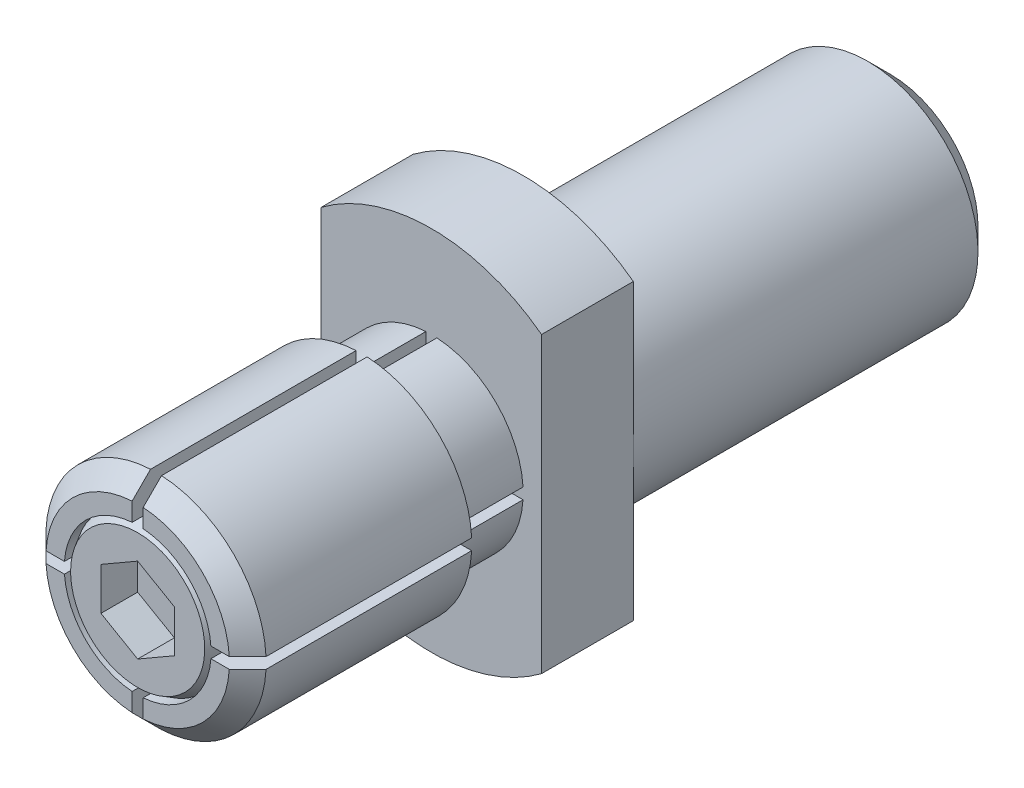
ISO-10303-21;
HEADER;
FILE_DESCRIPTION(('STEP AP214'),'2;1');
FILE_NAME('part.step','',(''),(''),'','','');
FILE_SCHEMA(('AUTOMOTIVE_DESIGN { 1 0 10303 214 1 1 1 1 }'));
ENDSEC;
DATA;
#1=APPLICATION_CONTEXT('core data for automotive mechanical design processes');
#2=APPLICATION_PROTOCOL_DEFINITION('international standard','automotive_design',2000,#1);
#3=PRODUCT_CONTEXT('',#1,'mechanical');
#4=PRODUCT('Part','Part','',(#3));
#5=PRODUCT_RELATED_PRODUCT_CATEGORY('part','',(#4));
#6=PRODUCT_DEFINITION_FORMATION('','',#4);
#7=PRODUCT_DEFINITION_CONTEXT('part definition',#1,'design');
#8=PRODUCT_DEFINITION('design','',#6,#7);
#9=PRODUCT_DEFINITION_SHAPE('','',#8);
#10=(LENGTH_UNIT() NAMED_UNIT(*) SI_UNIT(.MILLI.,.METRE.));
#11=(NAMED_UNIT(*) PLANE_ANGLE_UNIT() SI_UNIT($,.RADIAN.));
#12=(NAMED_UNIT(*) SI_UNIT($,.STERADIAN.) SOLID_ANGLE_UNIT());
#13=UNCERTAINTY_MEASURE_WITH_UNIT(LENGTH_MEASURE(1.E-05),#10,'distance_accuracy_value','');
#14=(GEOMETRIC_REPRESENTATION_CONTEXT(3) GLOBAL_UNCERTAINTY_ASSIGNED_CONTEXT((#13)) GLOBAL_UNIT_ASSIGNED_CONTEXT((#10,
#11,#12)) REPRESENTATION_CONTEXT('',''));
#15=CARTESIAN_POINT('',(0.,0.,0.));
#16=DIRECTION('',(0.,0.,1.));
#17=DIRECTION('',(1.,0.,0.));
#18=AXIS2_PLACEMENT_3D('',#15,#16,#17);
#19=CARTESIAN_POINT('',(0.,0.,10.5));
#20=DIRECTION('',(0.,0.,-1.));
#21=DIRECTION('',(0.,1.,0.));
#22=AXIS2_PLACEMENT_3D('',#19,#20,#21);
#23=PLANE('',#22);
#24=DIRECTION('',(0.,-1.,0.));
#25=VECTOR('',#24,1.);
#26=CARTESIAN_POINT('',(0.15,2.99624765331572,10.5));
#27=LINE('',#26,#25);
#28=CARTESIAN_POINT('',(0.15,2.49549594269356,10.5));
#29=VERTEX_POINT('',#28);
#30=CARTESIAN_POINT('',(0.15,1.99436706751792,10.5));
#31=VERTEX_POINT('',#30);
#32=EDGE_CURVE('E484',#29,#31,#27,.T.);
#33=ORIENTED_EDGE('',*,*,#32,.T.);
#34=CARTESIAN_POINT('',(0.,0.,10.5));
#35=DIRECTION('',(0.,0.,-1.));
#36=DIRECTION('',(0.,1.,0.));
#37=AXIS2_PLACEMENT_3D('',#34,#35,#36);
#38=CIRCLE('',#37,2.);
#39=CARTESIAN_POINT('',(1.99436706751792,0.15,10.5));
#40=VERTEX_POINT('',#39);
#41=EDGE_CURVE('E538',#31,#40,#38,.T.);
#42=ORIENTED_EDGE('',*,*,#41,.T.);
#43=DIRECTION('',(1.,0.,0.));
#44=VECTOR('',#43,1.);
#45=CARTESIAN_POINT('',(1.99436706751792,0.15,10.5));
#46=LINE('',#45,#44);
#47=CARTESIAN_POINT('',(2.49549594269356,0.15,10.5));
#48=VERTEX_POINT('',#47);
#49=EDGE_CURVE('E529',#40,#48,#46,.T.);
#50=ORIENTED_EDGE('',*,*,#49,.T.);
#51=CARTESIAN_POINT('',(0.,0.,10.5));
#52=DIRECTION('',(0.,0.,-1.));
#53=DIRECTION('',(0.,1.,0.));
#54=AXIS2_PLACEMENT_3D('',#51,#52,#53);
#55=CIRCLE('',#54,2.5);
#56=EDGE_CURVE('E541',#29,#48,#55,.T.);
#57=ORIENTED_EDGE('',*,*,#56,.F.);
#58=EDGE_LOOP('',(#33,#42,#50,#57));
#59=FACE_BOUND('',#58,.T.);
#60=ADVANCED_FACE('F14',(#59),#23,.F.);
#61=DIRECTION('',(-1.,0.,0.));
#62=VECTOR('',#61,1.);
#63=CARTESIAN_POINT('',(2.99624765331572,-0.15,10.5));
#64=LINE('',#63,#62);
#65=CARTESIAN_POINT('',(2.49549594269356,-0.15,10.5));
#66=VERTEX_POINT('',#65);
#67=CARTESIAN_POINT('',(1.99436706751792,-0.15,10.5));
#68=VERTEX_POINT('',#67);
#69=EDGE_CURVE('E523',#66,#68,#64,.T.);
#70=ORIENTED_EDGE('',*,*,#69,.T.);
#71=CARTESIAN_POINT('',(0.15,-1.99436706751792,10.5));
#72=VERTEX_POINT('',#71);
#73=EDGE_CURVE('E318',#68,#72,#38,.T.);
#74=ORIENTED_EDGE('',*,*,#73,.T.);
#75=DIRECTION('',(0.,-1.,0.));
#76=VECTOR('',#75,1.);
#77=CARTESIAN_POINT('',(0.15,-1.99436706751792,10.5));
#78=LINE('',#77,#76);
#79=CARTESIAN_POINT('',(0.15,-2.49549594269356,10.5));
#80=VERTEX_POINT('',#79);
#81=EDGE_CURVE('E316',#72,#80,#78,.T.);
#82=ORIENTED_EDGE('',*,*,#81,.T.);
#83=EDGE_CURVE('E528',#66,#80,#55,.T.);
#84=ORIENTED_EDGE('',*,*,#83,.F.);
#85=EDGE_LOOP('',(#70,#74,#82,#84));
#86=FACE_BOUND('',#85,.T.);
#87=ADVANCED_FACE('F441',(#86),#23,.F.);
#88=DIRECTION('',(0.,1.,0.));
#89=VECTOR('',#88,1.);
#90=CARTESIAN_POINT('',(-0.15,-2.99624765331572,10.5));
#91=LINE('',#90,#89);
#92=CARTESIAN_POINT('',(-0.15,-2.49549594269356,10.5));
#93=VERTEX_POINT('',#92);
#94=CARTESIAN_POINT('',(-0.15,-1.99436706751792,10.5));
#95=VERTEX_POINT('',#94);
#96=EDGE_CURVE('E533',#93,#95,#91,.T.);
#97=ORIENTED_EDGE('',*,*,#96,.T.);
#98=CARTESIAN_POINT('',(-1.99436706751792,-0.15,10.5));
#99=VERTEX_POINT('',#98);
#100=EDGE_CURVE('E828',#95,#99,#38,.T.);
#101=ORIENTED_EDGE('',*,*,#100,.T.);
#102=DIRECTION('',(-1.,0.,0.));
#103=VECTOR('',#102,1.);
#104=CARTESIAN_POINT('',(-1.99436706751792,-0.15,10.5));
#105=LINE('',#104,#103);
#106=CARTESIAN_POINT('',(-2.49549594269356,-0.15,10.5));
#107=VERTEX_POINT('',#106);
#108=EDGE_CURVE('E478',#99,#107,#105,.T.);
#109=ORIENTED_EDGE('',*,*,#108,.T.);
#110=EDGE_CURVE('E756',#93,#107,#55,.T.);
#111=ORIENTED_EDGE('',*,*,#110,.F.);
#112=EDGE_LOOP('',(#97,#101,#109,#111));
#113=FACE_BOUND('',#112,.T.);
#114=ADVANCED_FACE('F446',(#113),#23,.F.);
#115=DIRECTION('',(1.,0.,0.));
#116=VECTOR('',#115,1.);
#117=CARTESIAN_POINT('',(-2.99624765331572,0.15,10.5));
#118=LINE('',#117,#116);
#119=CARTESIAN_POINT('',(-2.49549594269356,0.15,10.5));
#120=VERTEX_POINT('',#119);
#121=CARTESIAN_POINT('',(-1.99436706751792,0.15,10.5));
#122=VERTEX_POINT('',#121);
#123=EDGE_CURVE('E469',#120,#122,#118,.T.);
#124=ORIENTED_EDGE('',*,*,#123,.T.);
#125=CARTESIAN_POINT('',(-0.15,1.99436706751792,10.5));
#126=VERTEX_POINT('',#125);
#127=EDGE_CURVE('E471',#122,#126,#38,.T.);
#128=ORIENTED_EDGE('',*,*,#127,.T.);
#129=DIRECTION('',(0.,1.,0.));
#130=VECTOR('',#129,1.);
#131=CARTESIAN_POINT('',(-0.15,1.99436706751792,10.5));
#132=LINE('',#131,#130);
#133=CARTESIAN_POINT('',(-0.15,2.49549594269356,10.5));
#134=VERTEX_POINT('',#133);
#135=EDGE_CURVE('E479',#126,#134,#132,.T.);
#136=ORIENTED_EDGE('',*,*,#135,.T.);
#137=EDGE_CURVE('E474',#120,#134,#55,.T.);
#138=ORIENTED_EDGE('',*,*,#137,.F.);
#139=EDGE_LOOP('',(#124,#128,#136,#138));
#140=FACE_BOUND('',#139,.T.);
#141=ADVANCED_FACE('F449',(#140),#23,.F.);
#142=CARTESIAN_POINT('',(0.,0.,10.5));
#143=DIRECTION('',(0.,0.,-1.));
#144=DIRECTION('',(0.,1.,0.));
#145=AXIS2_PLACEMENT_3D('',#142,#143,#144);
#146=CONICAL_SURFACE('',#145,2.5,0.785398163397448);
#147=CARTESIAN_POINT('',(-4.44435584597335,-0.15,8.55311357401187));
#148=CARTESIAN_POINT('',(-4.18217438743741,-0.150000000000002,8.81513717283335));
#149=CARTESIAN_POINT('',(-3.919987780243,-0.150000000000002,9.07715563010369));
#150=CARTESIAN_POINT('',(-3.39556505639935,-0.150000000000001,9.60114283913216));
#151=CARTESIAN_POINT('',(-3.13332893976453,-0.15,9.86311159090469));
#152=CARTESIAN_POINT('',(-2.60876772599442,-0.15,10.3869602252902));
#153=CARTESIAN_POINT('',(-2.34644262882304,-0.15,10.6488401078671));
#154=CARTESIAN_POINT('',(-1.95278350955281,-0.15,11.0414881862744));
#155=CARTESIAN_POINT('',(-1.82153520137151,-0.15,11.1723422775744));
#156=CARTESIAN_POINT('',(-1.55891266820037,-0.15,11.4339241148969));
#157=CARTESIAN_POINT('',(-1.42753844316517,-0.15,11.5646518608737));
#158=CARTESIAN_POINT('',(-1.29606691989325,-0.15,11.6952818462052));
#159=B_SPLINE_CURVE_WITH_KNOTS('',3,(#147,#148,#149,#150,#151,#152,#153,#154,#155,#156,#157,
#158),.UNSPECIFIED.,.F.,.F.,(4,2,2,2,2,4),(0.,1.11200691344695,2.22401350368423,3.336020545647,
3.89202426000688,4.44802817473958),.UNSPECIFIED.);
#160=CARTESIAN_POINT('',(-2.99624765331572,-0.15,10.));
#161=VERTEX_POINT('',#160);
#162=EDGE_CURVE('E716',#161,#107,#159,.T.);
#163=ORIENTED_EDGE('',*,*,#162,.F.);
#164=CARTESIAN_POINT('',(0.,0.,10.));
#165=DIRECTION('',(0.,0.,-1.));
#166=DIRECTION('',(0.,1.,0.));
#167=AXIS2_PLACEMENT_3D('',#164,#165,#166);
#168=CIRCLE('',#167,3.);
#169=CARTESIAN_POINT('',(-0.15,-2.99624765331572,10.));
#170=VERTEX_POINT('',#169);
#171=EDGE_CURVE('E617',#170,#161,#168,.T.);
#172=ORIENTED_EDGE('',*,*,#171,.F.);
#173=CARTESIAN_POINT('',(-0.15,-1.04480193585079,11.944485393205));
#174=CARTESIAN_POINT('',(-0.15,-1.11803539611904,11.871983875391));
#175=CARTESIAN_POINT('',(-0.15,-1.19120421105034,11.799417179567));
#176=CARTESIAN_POINT('',(-0.15,-1.33745169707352,11.6541930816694));
#177=CARTESIAN_POINT('',(-0.15,-1.41053036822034,11.581535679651));
#178=CARTESIAN_POINT('',(-0.15,-1.62968989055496,11.3634868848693));
#179=CARTESIAN_POINT('',(-0.15,-1.77569438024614,11.2180187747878));
#180=CARTESIAN_POINT('',(-0.15,-2.03819374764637,10.9563132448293));
#181=CARTESIAN_POINT('',(-0.15,-2.15470581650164,10.840093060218));
#182=CARTESIAN_POINT('',(-0.15,-2.38769133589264,10.6076139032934));
#183=CARTESIAN_POINT('',(-0.15,-2.50416478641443,10.4913549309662));
#184=CARTESIAN_POINT('',(-0.15,-2.88294403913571,10.1131966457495));
#185=CARTESIAN_POINT('',(-0.15,-3.14520191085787,9.85124932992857));
#186=CARTESIAN_POINT('',(-0.15,-3.66965562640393,9.32729310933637));
#187=CARTESIAN_POINT('',(-0.15,-3.93185147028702,9.06528420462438));
#188=CARTESIAN_POINT('',(-0.15,-4.19404523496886,8.80327324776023));
#189=B_SPLINE_CURVE_WITH_KNOTS('',3,(#173,#174,#175,#176,#177,#178,#179,#180,#181,#182,#183,
#184,#185,#186,#187,#188),.UNSPECIFIED.,.F.,.F.,(4,2,2,2,2,2,2,4),(0.,0.3091543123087,
0.618308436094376,1.2366161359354,1.73031618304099,2.22401640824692,3.3360237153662,
4.44802995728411),.UNSPECIFIED.);
#190=EDGE_CURVE('E341',#93,#170,#189,.T.);
#191=ORIENTED_EDGE('',*,*,#190,.F.);
#192=ORIENTED_EDGE('',*,*,#110,.T.);
#193=EDGE_LOOP('',(#163,#172,#191,#192));
#194=FACE_BOUND('',#193,.T.);
#195=ADVANCED_FACE('F352',(#194),#146,.T.);
#196=CARTESIAN_POINT('',(-1.29606691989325,0.15,11.6952818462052));
#197=CARTESIAN_POINT('',(-1.3864336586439,0.15,11.6055052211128));
#198=CARTESIAN_POINT('',(-1.4767482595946,0.15,11.5156761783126));
#199=CARTESIAN_POINT('',(-1.65730478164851,0.15,11.3359451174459));
#200=CARTESIAN_POINT('',(-1.74754670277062,0.15,11.2460430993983));
#201=CARTESIAN_POINT('',(-2.01821084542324,0.15,10.976275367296));
#202=CARTESIAN_POINT('',(-2.1985715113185,0.15,10.7963479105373));
#203=CARTESIAN_POINT('',(-2.54297251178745,0.15,10.4526271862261));
#204=CARTESIAN_POINT('',(-2.70701946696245,0.15,10.2888405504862));
#205=CARTESIAN_POINT('',(-3.1333301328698,0.15,9.86311264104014));
#206=CARTESIAN_POINT('',(-3.39556576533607,0.15,9.60114325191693));
#207=CARTESIAN_POINT('',(-3.91998737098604,0.15,9.07715491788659));
#208=CARTESIAN_POINT('',(-4.18217334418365,0.15,8.81513597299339));
#209=CARTESIAN_POINT('',(-4.44435584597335,0.15,8.55311357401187));
#210=B_SPLINE_CURVE_WITH_KNOTS('',3,(#196,#197,#198,#199,#200,#201,#202,#203,#204,#205,#206,
#207,#208,#209),.UNSPECIFIED.,.F.,.F.,(4,2,2,2,2,2,4),(0.,0.382143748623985,0.764287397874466,
1.52857442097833,2.22401470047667,3.33602160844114,4.4480282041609),.UNSPECIFIED.);
#211=CARTESIAN_POINT('',(-2.99624765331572,0.15,10.));
#212=VERTEX_POINT('',#211);
#213=EDGE_CURVE('E739',#120,#212,#210,.T.);
#214=ORIENTED_EDGE('',*,*,#213,.F.);
#215=ORIENTED_EDGE('',*,*,#137,.T.);
#216=CARTESIAN_POINT('',(-0.150000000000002,4.44435584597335,8.55311357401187));
#217=CARTESIAN_POINT('',(-0.150000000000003,4.18217438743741,8.81513717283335));
#218=CARTESIAN_POINT('',(-0.150000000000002,3.919987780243,9.07715563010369));
#219=CARTESIAN_POINT('',(-0.150000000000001,3.39556505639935,9.60114283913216));
#220=CARTESIAN_POINT('',(-0.15,3.13332893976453,9.86311159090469));
#221=CARTESIAN_POINT('',(-0.15,2.60876772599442,10.3869602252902));
#222=CARTESIAN_POINT('',(-0.15,2.34644262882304,10.6488401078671));
#223=CARTESIAN_POINT('',(-0.15,1.95278350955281,11.0414881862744));
#224=CARTESIAN_POINT('',(-0.15,1.82153520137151,11.1723422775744));
#225=CARTESIAN_POINT('',(-0.15,1.55891266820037,11.4339241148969));
#226=CARTESIAN_POINT('',(-0.15,1.42753844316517,11.5646518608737));
#227=CARTESIAN_POINT('',(-0.15,1.29606691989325,11.6952818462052));
#228=B_SPLINE_CURVE_WITH_KNOTS('',3,(#216,#217,#218,#219,#220,#221,#222,#223,#224,#225,#226,
#227),.UNSPECIFIED.,.F.,.F.,(4,2,2,2,2,4),(0.,1.11200691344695,2.22401350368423,3.336020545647,
3.89202426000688,4.44802817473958),.UNSPECIFIED.);
#229=CARTESIAN_POINT('',(-0.15,2.99624765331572,10.));
#230=VERTEX_POINT('',#229);
#231=EDGE_CURVE('E556',#230,#134,#228,.T.);
#232=ORIENTED_EDGE('',*,*,#231,.F.);
#233=EDGE_CURVE('E620',#212,#230,#168,.T.);
#234=ORIENTED_EDGE('',*,*,#233,.F.);
#235=EDGE_LOOP('',(#214,#215,#232,#234));
#236=FACE_BOUND('',#235,.T.);
#237=ADVANCED_FACE('F463',(#236),#146,.T.);
#238=CARTESIAN_POINT('',(0.15,1.29606691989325,11.6952818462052));
#239=CARTESIAN_POINT('',(0.15,1.3864336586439,11.6055052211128));
#240=CARTESIAN_POINT('',(0.15,1.4767482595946,11.5156761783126));
#241=CARTESIAN_POINT('',(0.15,1.65730478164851,11.3359451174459));
#242=CARTESIAN_POINT('',(0.15,1.74754670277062,11.2460430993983));
#243=CARTESIAN_POINT('',(0.15,2.01821084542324,10.976275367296));
#244=CARTESIAN_POINT('',(0.15,2.1985715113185,10.7963479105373));
#245=CARTESIAN_POINT('',(0.15,2.54297251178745,10.4526271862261));
#246=CARTESIAN_POINT('',(0.15,2.70701946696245,10.2888405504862));
#247=CARTESIAN_POINT('',(0.15,3.1333301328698,9.86311264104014));
#248=CARTESIAN_POINT('',(0.15,3.39556576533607,9.60114325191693));
#249=CARTESIAN_POINT('',(0.15,3.91998737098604,9.07715491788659));
#250=CARTESIAN_POINT('',(0.15,4.18217334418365,8.81513597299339));
#251=CARTESIAN_POINT('',(0.15,4.44435584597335,8.55311357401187));
#252=B_SPLINE_CURVE_WITH_KNOTS('',3,(#238,#239,#240,#241,#242,#243,#244,#245,#246,#247,#248,
#249,#250,#251),.UNSPECIFIED.,.F.,.F.,(4,2,2,2,2,2,4),(0.,0.382143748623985,0.764287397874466,
1.52857442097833,2.22401470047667,3.33602160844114,4.4480282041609),.UNSPECIFIED.);
#253=CARTESIAN_POINT('',(0.15,2.99624765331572,10.));
#254=VERTEX_POINT('',#253);
#255=EDGE_CURVE('E546',#29,#254,#252,.T.);
#256=ORIENTED_EDGE('',*,*,#255,.F.);
#257=ORIENTED_EDGE('',*,*,#56,.T.);
#258=CARTESIAN_POINT('',(4.19404523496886,0.15,8.80327324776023));
#259=CARTESIAN_POINT('',(3.93185161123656,0.150000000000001,9.06528475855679));
#260=CARTESIAN_POINT('',(3.66965539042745,0.150000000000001,9.32729369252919));
#261=CARTESIAN_POINT('',(3.14520132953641,0.150000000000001,9.85124956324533));
#262=CARTESIAN_POINT('',(2.88294348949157,0.15,10.1131965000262));
#263=CARTESIAN_POINT('',(2.48946782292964,0.15,10.5060281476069));
#264=CARTESIAN_POINT('',(2.35829438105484,0.15,10.6369573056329));
#265=CARTESIAN_POINT('',(2.09589448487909,0.15,10.8987624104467));
#266=CARTESIAN_POINT('',(1.96466803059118,0.15,11.0296383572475));
#267=CARTESIAN_POINT('',(1.70213330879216,0.15,11.2913084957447));
#268=CARTESIAN_POINT('',(1.57082504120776,0.15,11.4221026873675));
#269=CARTESIAN_POINT('',(1.30800075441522,0.15,11.683482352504));
#270=CARTESIAN_POINT('',(1.17648473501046,0.15,11.81406782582));
#271=CARTESIAN_POINT('',(1.04480193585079,0.15,11.944485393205));
#272=B_SPLINE_CURVE_WITH_KNOTS('',3,(#258,#259,#260,#261,#262,#263,#264,#265,#266,#267,#268,
#269,#270,#271),.UNSPECIFIED.,.F.,.F.,(4,2,2,2,2,2,4),(0.,1.11200710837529,2.22401354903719,
2.78001735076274,3.33602101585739,3.89202517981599,4.44802987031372),.UNSPECIFIED.);
#273=CARTESIAN_POINT('',(2.99624765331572,0.15,10.));
#274=VERTEX_POINT('',#273);
#275=EDGE_CURVE('E558',#274,#48,#272,.T.);
#276=ORIENTED_EDGE('',*,*,#275,.F.);
#277=EDGE_CURVE('E551',#254,#274,#168,.T.);
#278=ORIENTED_EDGE('',*,*,#277,.F.);
#279=EDGE_LOOP('',(#256,#257,#276,#278));
#280=FACE_BOUND('',#279,.T.);
#281=ADVANCED_FACE('F435',(#280),#146,.T.);
#282=CARTESIAN_POINT('',(1.04480193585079,-0.15,11.944485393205));
#283=CARTESIAN_POINT('',(1.11803539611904,-0.15,11.871983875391));
#284=CARTESIAN_POINT('',(1.19120421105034,-0.15,11.799417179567));
#285=CARTESIAN_POINT('',(1.33745169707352,-0.15,11.6541930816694));
#286=CARTESIAN_POINT('',(1.41053036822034,-0.15,11.581535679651));
#287=CARTESIAN_POINT('',(1.62968989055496,-0.15,11.3634868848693));
#288=CARTESIAN_POINT('',(1.77569438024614,-0.15,11.2180187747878));
#289=CARTESIAN_POINT('',(2.03819374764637,-0.15,10.9563132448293));
#290=CARTESIAN_POINT('',(2.15470581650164,-0.15,10.840093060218));
#291=CARTESIAN_POINT('',(2.38769133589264,-0.15,10.6076139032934));
#292=CARTESIAN_POINT('',(2.50416478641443,-0.15,10.4913549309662));
#293=CARTESIAN_POINT('',(2.88294403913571,-0.15,10.1131966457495));
#294=CARTESIAN_POINT('',(3.14520191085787,-0.15,9.85124932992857));
#295=CARTESIAN_POINT('',(3.66965562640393,-0.15,9.32729310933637));
#296=CARTESIAN_POINT('',(3.93185147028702,-0.15,9.06528420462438));
#297=CARTESIAN_POINT('',(4.19404523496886,-0.15,8.80327324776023));
#298=B_SPLINE_CURVE_WITH_KNOTS('',3,(#282,#283,#284,#285,#286,#287,#288,#289,#290,#291,#292,
#293,#294,#295,#296,#297),.UNSPECIFIED.,.F.,.F.,(4,2,2,2,2,2,2,4),(0.,0.3091543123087,
0.618308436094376,1.2366161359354,1.73031618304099,2.22401640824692,3.3360237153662,
4.44802995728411),.UNSPECIFIED.);
#299=CARTESIAN_POINT('',(2.99624765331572,-0.15,10.));
#300=VERTEX_POINT('',#299);
#301=EDGE_CURVE('E590',#66,#300,#298,.T.);
#302=ORIENTED_EDGE('',*,*,#301,.F.);
#303=ORIENTED_EDGE('',*,*,#83,.T.);
#304=CARTESIAN_POINT('',(0.15,-4.19404523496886,8.80327324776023));
#305=CARTESIAN_POINT('',(0.150000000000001,-3.93185161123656,9.06528475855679));
#306=CARTESIAN_POINT('',(0.150000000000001,-3.66965539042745,9.32729369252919));
#307=CARTESIAN_POINT('',(0.150000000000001,-3.14520132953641,9.85124956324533));
#308=CARTESIAN_POINT('',(0.15,-2.88294348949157,10.1131965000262));
#309=CARTESIAN_POINT('',(0.15,-2.48946782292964,10.5060281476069));
#310=CARTESIAN_POINT('',(0.15,-2.35829438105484,10.6369573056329));
#311=CARTESIAN_POINT('',(0.15,-2.09589448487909,10.8987624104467));
#312=CARTESIAN_POINT('',(0.15,-1.96466803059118,11.0296383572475));
#313=CARTESIAN_POINT('',(0.15,-1.70213330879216,11.2913084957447));
#314=CARTESIAN_POINT('',(0.15,-1.57082504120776,11.4221026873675));
#315=CARTESIAN_POINT('',(0.15,-1.30800075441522,11.683482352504));
#316=CARTESIAN_POINT('',(0.15,-1.17648473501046,11.81406782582));
#317=CARTESIAN_POINT('',(0.15,-1.04480193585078,11.944485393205));
#318=B_SPLINE_CURVE_WITH_KNOTS('',3,(#304,#305,#306,#307,#308,#309,#310,#311,#312,#313,#314,
#315,#316,#317),.UNSPECIFIED.,.F.,.F.,(4,2,2,2,2,2,4),(0.,1.11200710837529,2.22401354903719,
2.78001735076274,3.33602101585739,3.89202517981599,4.44802987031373),.UNSPECIFIED.);
#319=CARTESIAN_POINT('',(0.15,-2.99624765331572,10.));
#320=VERTEX_POINT('',#319);
#321=EDGE_CURVE('E601',#320,#80,#318,.T.);
#322=ORIENTED_EDGE('',*,*,#321,.F.);
#323=EDGE_CURVE('E616',#300,#320,#168,.T.);
#324=ORIENTED_EDGE('',*,*,#323,.F.);
#325=EDGE_LOOP('',(#302,#303,#322,#324));
#326=FACE_BOUND('',#325,.T.);
#327=ADVANCED_FACE('F426',(#326),#146,.T.);
#328=CARTESIAN_POINT('',(0.,0.,2.5));
#329=DIRECTION('',(0.,0.,-1.));
#330=DIRECTION('',(0.,1.,0.));
#331=AXIS2_PLACEMENT_3D('',#328,#329,#330);
#332=CYLINDRICAL_SURFACE('',#331,3.);
#333=DIRECTION('',(0.,0.,1.));
#334=VECTOR('',#333,1.);
#335=CARTESIAN_POINT('',(-2.99624765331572,-0.15,2.5));
#336=LINE('',#335,#334);
#337=CARTESIAN_POINT('',(-2.99624765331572,-0.15,4.4));
#338=VERTEX_POINT('',#337);
#339=EDGE_CURVE('E335',#338,#161,#336,.T.);
#340=ORIENTED_EDGE('',*,*,#339,.F.);
#341=CARTESIAN_POINT('',(0.,0.,4.4));
#342=DIRECTION('',(0.,0.,-1.));
#343=DIRECTION('',(0.,1.,0.));
#344=AXIS2_PLACEMENT_3D('',#341,#342,#343);
#345=CIRCLE('',#344,3.);
#346=CARTESIAN_POINT('',(-0.15,-2.99624765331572,4.4));
#347=VERTEX_POINT('',#346);
#348=EDGE_CURVE('E624',#347,#338,#345,.T.);
#349=ORIENTED_EDGE('',*,*,#348,.F.);
#350=DIRECTION('',(0.,0.,1.));
#351=VECTOR('',#350,1.);
#352=CARTESIAN_POINT('',(-0.15,-2.99624765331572,2.5));
#353=LINE('',#352,#351);
#354=EDGE_CURVE('E329',#347,#170,#353,.T.);
#355=ORIENTED_EDGE('',*,*,#354,.T.);
#356=ORIENTED_EDGE('',*,*,#171,.T.);
#357=EDGE_LOOP('',(#340,#349,#355,#356));
#358=FACE_BOUND('',#357,.T.);
#359=ADVANCED_FACE('F423',(#358),#332,.T.);
#360=DIRECTION('',(0.,0.,1.));
#361=VECTOR('',#360,1.);
#362=CARTESIAN_POINT('',(-0.15,2.99624765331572,2.5));
#363=LINE('',#362,#361);
#364=CARTESIAN_POINT('',(-0.15,2.99624765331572,4.4));
#365=VERTEX_POINT('',#364);
#366=EDGE_CURVE('E496',#365,#230,#363,.T.);
#367=ORIENTED_EDGE('',*,*,#366,.F.);
#368=CARTESIAN_POINT('',(-2.99624765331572,0.15,4.4));
#369=VERTEX_POINT('',#368);
#370=EDGE_CURVE('E627',#369,#365,#345,.T.);
#371=ORIENTED_EDGE('',*,*,#370,.F.);
#372=DIRECTION('',(0.,0.,1.));
#373=VECTOR('',#372,1.);
#374=CARTESIAN_POINT('',(-2.99624765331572,0.15,2.5));
#375=LINE('',#374,#373);
#376=EDGE_CURVE('E493',#369,#212,#375,.T.);
#377=ORIENTED_EDGE('',*,*,#376,.T.);
#378=ORIENTED_EDGE('',*,*,#233,.T.);
#379=EDGE_LOOP('',(#367,#371,#377,#378));
#380=FACE_BOUND('',#379,.T.);
#381=ADVANCED_FACE('F425',(#380),#332,.T.);
#382=DIRECTION('',(0.,0.,1.));
#383=VECTOR('',#382,1.);
#384=CARTESIAN_POINT('',(2.99624765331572,0.15,2.5));
#385=LINE('',#384,#383);
#386=CARTESIAN_POINT('',(2.99624765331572,0.15,4.4));
#387=VERTEX_POINT('',#386);
#388=EDGE_CURVE('E508',#387,#274,#385,.T.);
#389=ORIENTED_EDGE('',*,*,#388,.F.);
#390=CARTESIAN_POINT('',(0.15,2.99624765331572,4.4));
#391=VERTEX_POINT('',#390);
#392=EDGE_CURVE('E625',#391,#387,#345,.T.);
#393=ORIENTED_EDGE('',*,*,#392,.F.);
#394=DIRECTION('',(0.,0.,1.));
#395=VECTOR('',#394,1.);
#396=CARTESIAN_POINT('',(0.15,2.99624765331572,2.5));
#397=LINE('',#396,#395);
#398=EDGE_CURVE('E505',#391,#254,#397,.T.);
#399=ORIENTED_EDGE('',*,*,#398,.T.);
#400=ORIENTED_EDGE('',*,*,#277,.T.);
#401=EDGE_LOOP('',(#389,#393,#399,#400));
#402=FACE_BOUND('',#401,.T.);
#403=ADVANCED_FACE('F433',(#402),#332,.T.);
#404=DIRECTION('',(0.,0.,1.));
#405=VECTOR('',#404,1.);
#406=CARTESIAN_POINT('',(0.15,-2.99624765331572,2.5));
#407=LINE('',#406,#405);
#408=CARTESIAN_POINT('',(0.15,-2.99624765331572,4.4));
#409=VERTEX_POINT('',#408);
#410=EDGE_CURVE('E323',#409,#320,#407,.T.);
#411=ORIENTED_EDGE('',*,*,#410,.F.);
#412=CARTESIAN_POINT('',(2.99624765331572,-0.15,4.4));
#413=VERTEX_POINT('',#412);
#414=EDGE_CURVE('E615',#413,#409,#345,.T.);
#415=ORIENTED_EDGE('',*,*,#414,.F.);
#416=DIRECTION('',(0.,0.,1.));
#417=VECTOR('',#416,1.);
#418=CARTESIAN_POINT('',(2.99624765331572,-0.15,2.5));
#419=LINE('',#418,#417);
#420=EDGE_CURVE('E327',#413,#300,#419,.T.);
#421=ORIENTED_EDGE('',*,*,#420,.T.);
#422=ORIENTED_EDGE('',*,*,#323,.T.);
#423=EDGE_LOOP('',(#411,#415,#421,#422));
#424=FACE_BOUND('',#423,.T.);
#425=ADVANCED_FACE('F421',(#424),#332,.T.);
#426=CARTESIAN_POINT('',(3.,0.,4.4));
#427=DIRECTION('',(0.,0.,1.));
#428=DIRECTION('',(0.,-1.,0.));
#429=AXIS2_PLACEMENT_3D('',#426,#427,#428);
#430=PLANE('',#429);
#431=DIRECTION('',(-1.,0.,0.));
#432=VECTOR('',#431,1.);
#433=CARTESIAN_POINT('',(3.,-0.149999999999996,4.4));
#434=LINE('',#433,#432);
#435=CARTESIAN_POINT('',(-2.49549594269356,-0.15,4.4));
#436=VERTEX_POINT('',#435);
#437=EDGE_CURVE('E723',#436,#338,#434,.T.);
#438=ORIENTED_EDGE('',*,*,#437,.F.);
#439=CARTESIAN_POINT('',(0.,0.,4.4));
#440=DIRECTION('',(0.,0.,-1.));
#441=DIRECTION('',(0.,1.,0.));
#442=AXIS2_PLACEMENT_3D('',#439,#440,#441);
#443=CIRCLE('',#442,2.5);
#444=CARTESIAN_POINT('',(-0.15,-2.49549594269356,4.4));
#445=VERTEX_POINT('',#444);
#446=EDGE_CURVE('E634',#445,#436,#443,.T.);
#447=ORIENTED_EDGE('',*,*,#446,.F.);
#448=DIRECTION('',(0.,1.,0.));
#449=VECTOR('',#448,1.);
#450=CARTESIAN_POINT('',(-0.15,0.,4.4));
#451=LINE('',#450,#449);
#452=EDGE_CURVE('E339',#347,#445,#451,.T.);
#453=ORIENTED_EDGE('',*,*,#452,.F.);
#454=ORIENTED_EDGE('',*,*,#348,.T.);
#455=EDGE_LOOP('',(#438,#447,#453,#454));
#456=FACE_BOUND('',#455,.T.);
#457=ADVANCED_FACE('F418',(#456),#430,.F.);
#458=DIRECTION('',(1.,0.,0.));
#459=VECTOR('',#458,1.);
#460=CARTESIAN_POINT('',(3.,0.15,4.4));
#461=LINE('',#460,#459);
#462=CARTESIAN_POINT('',(-2.49549594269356,0.15,4.4));
#463=VERTEX_POINT('',#462);
#464=EDGE_CURVE('E745',#369,#463,#461,.T.);
#465=ORIENTED_EDGE('',*,*,#464,.F.);
#466=ORIENTED_EDGE('',*,*,#370,.T.);
#467=DIRECTION('',(0.,1.,0.));
#468=VECTOR('',#467,1.);
#469=CARTESIAN_POINT('',(-0.149999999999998,0.,4.4));
#470=LINE('',#469,#468);
#471=CARTESIAN_POINT('',(-0.15,2.49549594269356,4.4));
#472=VERTEX_POINT('',#471);
#473=EDGE_CURVE('E552',#472,#365,#470,.T.);
#474=ORIENTED_EDGE('',*,*,#473,.F.);
#475=EDGE_CURVE('E639',#463,#472,#443,.T.);
#476=ORIENTED_EDGE('',*,*,#475,.F.);
#477=EDGE_LOOP('',(#465,#466,#474,#476));
#478=FACE_BOUND('',#477,.T.);
#479=ADVANCED_FACE('F420',(#478),#430,.F.);
#480=DIRECTION('',(0.,-1.,0.));
#481=VECTOR('',#480,1.);
#482=CARTESIAN_POINT('',(0.15,0.,4.4));
#483=LINE('',#482,#481);
#484=CARTESIAN_POINT('',(0.15,2.49549594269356,4.4));
#485=VERTEX_POINT('',#484);
#486=EDGE_CURVE('E553',#391,#485,#483,.T.);
#487=ORIENTED_EDGE('',*,*,#486,.F.);
#488=ORIENTED_EDGE('',*,*,#392,.T.);
#489=DIRECTION('',(1.,0.,0.));
#490=VECTOR('',#489,1.);
#491=CARTESIAN_POINT('',(3.,0.15,4.4));
#492=LINE('',#491,#490);
#493=CARTESIAN_POINT('',(2.49549594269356,0.15,4.4));
#494=VERTEX_POINT('',#493);
#495=EDGE_CURVE('E587',#494,#387,#492,.T.);
#496=ORIENTED_EDGE('',*,*,#495,.F.);
#497=EDGE_CURVE('E635',#485,#494,#443,.T.);
#498=ORIENTED_EDGE('',*,*,#497,.F.);
#499=EDGE_LOOP('',(#487,#488,#496,#498));
#500=FACE_BOUND('',#499,.T.);
#501=ADVANCED_FACE('F882',(#500),#430,.F.);
#502=DIRECTION('',(-1.,0.,0.));
#503=VECTOR('',#502,1.);
#504=CARTESIAN_POINT('',(3.,-0.15,4.4));
#505=LINE('',#504,#503);
#506=CARTESIAN_POINT('',(2.49549594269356,-0.15,4.4));
#507=VERTEX_POINT('',#506);
#508=EDGE_CURVE('E596',#413,#507,#505,.T.);
#509=ORIENTED_EDGE('',*,*,#508,.F.);
#510=ORIENTED_EDGE('',*,*,#414,.T.);
#511=DIRECTION('',(0.,-1.,0.));
#512=VECTOR('',#511,1.);
#513=CARTESIAN_POINT('',(0.149999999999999,0.,4.4));
#514=LINE('',#513,#512);
#515=CARTESIAN_POINT('',(0.15,-2.49549594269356,4.4));
#516=VERTEX_POINT('',#515);
#517=EDGE_CURVE('E350',#516,#409,#514,.T.);
#518=ORIENTED_EDGE('',*,*,#517,.F.);
#519=EDGE_CURVE('E629',#507,#516,#443,.T.);
#520=ORIENTED_EDGE('',*,*,#519,.F.);
#521=EDGE_LOOP('',(#509,#510,#518,#520));
#522=FACE_BOUND('',#521,.T.);
#523=ADVANCED_FACE('F415',(#522),#430,.F.);
#524=CARTESIAN_POINT('',(0.,0.,2.5));
#525=DIRECTION('',(0.,0.,-1.));
#526=DIRECTION('',(0.,1.,0.));
#527=AXIS2_PLACEMENT_3D('',#524,#525,#526);
#528=CYLINDRICAL_SURFACE('',#527,2.5);
#529=DIRECTION('',(0.,0.,-1.));
#530=VECTOR('',#529,1.);
#531=CARTESIAN_POINT('',(-2.49549594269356,-0.15,2.5));
#532=LINE('',#531,#530);
#533=CARTESIAN_POINT('',(-2.49549594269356,-0.15,2.5));
#534=VERTEX_POINT('',#533);
#535=EDGE_CURVE('E22',#534,#436,#532,.F.);
#536=ORIENTED_EDGE('',*,*,#535,.F.);
#537=CARTESIAN_POINT('',(0.,0.,2.5));
#538=DIRECTION('',(0.,0.,-1.));
#539=DIRECTION('',(0.,1.,0.));
#540=AXIS2_PLACEMENT_3D('',#537,#538,#539);
#541=CIRCLE('',#540,2.5);
#542=CARTESIAN_POINT('',(-0.15,-2.49549594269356,2.5));
#543=VERTEX_POINT('',#542);
#544=EDGE_CURVE('E649',#543,#534,#541,.T.);
#545=ORIENTED_EDGE('',*,*,#544,.F.);
#546=DIRECTION('',(0.,0.,-1.));
#547=VECTOR('',#546,1.);
#548=CARTESIAN_POINT('',(-0.15,-2.49549594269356,2.5));
#549=LINE('',#548,#547);
#550=EDGE_CURVE('E797',#445,#543,#549,.T.);
#551=ORIENTED_EDGE('',*,*,#550,.F.);
#552=ORIENTED_EDGE('',*,*,#446,.T.);
#553=EDGE_LOOP('',(#536,#545,#551,#552));
#554=FACE_BOUND('',#553,.T.);
#555=ADVANCED_FACE('F411',(#554),#528,.T.);
#556=DIRECTION('',(0.,0.,-1.));
#557=VECTOR('',#556,1.);
#558=CARTESIAN_POINT('',(-2.49549594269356,0.15,2.5));
#559=LINE('',#558,#557);
#560=CARTESIAN_POINT('',(-2.49549594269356,0.15,2.5));
#561=VERTEX_POINT('',#560);
#562=EDGE_CURVE('E809',#463,#561,#559,.T.);
#563=ORIENTED_EDGE('',*,*,#562,.F.);
#564=ORIENTED_EDGE('',*,*,#475,.T.);
#565=DIRECTION('',(0.,0.,-1.));
#566=VECTOR('',#565,1.);
#567=CARTESIAN_POINT('',(-0.15,2.49549594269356,2.5));
#568=LINE('',#567,#566);
#569=CARTESIAN_POINT('',(-0.15,2.49549594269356,2.5));
#570=VERTEX_POINT('',#569);
#571=EDGE_CURVE('E807',#570,#472,#568,.F.);
#572=ORIENTED_EDGE('',*,*,#571,.F.);
#573=EDGE_CURVE('E654',#561,#570,#541,.T.);
#574=ORIENTED_EDGE('',*,*,#573,.F.);
#575=EDGE_LOOP('',(#563,#564,#572,#574));
#576=FACE_BOUND('',#575,.T.);
#577=ADVANCED_FACE('F414',(#576),#528,.T.);
#578=DIRECTION('',(0.,0.,-1.));
#579=VECTOR('',#578,1.);
#580=CARTESIAN_POINT('',(0.15,2.49549594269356,2.5));
#581=LINE('',#580,#579);
#582=CARTESIAN_POINT('',(0.15,2.49549594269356,2.5));
#583=VERTEX_POINT('',#582);
#584=EDGE_CURVE('E805',#485,#583,#581,.T.);
#585=ORIENTED_EDGE('',*,*,#584,.F.);
#586=ORIENTED_EDGE('',*,*,#497,.T.);
#587=DIRECTION('',(0.,0.,-1.));
#588=VECTOR('',#587,1.);
#589=CARTESIAN_POINT('',(2.49549594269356,0.15,2.5));
#590=LINE('',#589,#588);
#591=CARTESIAN_POINT('',(2.49549594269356,0.15,2.5));
#592=VERTEX_POINT('',#591);
#593=EDGE_CURVE('E803',#592,#494,#590,.F.);
#594=ORIENTED_EDGE('',*,*,#593,.F.);
#595=EDGE_CURVE('E650',#583,#592,#541,.T.);
#596=ORIENTED_EDGE('',*,*,#595,.F.);
#597=EDGE_LOOP('',(#585,#586,#594,#596));
#598=FACE_BOUND('',#597,.T.);
#599=ADVANCED_FACE('F890',(#598),#528,.T.);
#600=DIRECTION('',(0.,0.,-1.));
#601=VECTOR('',#600,1.);
#602=CARTESIAN_POINT('',(2.49549594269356,-0.15,2.5));
#603=LINE('',#602,#601);
#604=CARTESIAN_POINT('',(2.49549594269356,-0.15,2.5));
#605=VERTEX_POINT('',#604);
#606=EDGE_CURVE('E801',#507,#605,#603,.T.);
#607=ORIENTED_EDGE('',*,*,#606,.F.);
#608=ORIENTED_EDGE('',*,*,#519,.T.);
#609=DIRECTION('',(0.,0.,-1.));
#610=VECTOR('',#609,1.);
#611=CARTESIAN_POINT('',(0.15,-2.49549594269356,2.5));
#612=LINE('',#611,#610);
#613=CARTESIAN_POINT('',(0.15,-2.49549594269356,2.5));
#614=VERTEX_POINT('',#613);
#615=EDGE_CURVE('E611',#614,#516,#612,.F.);
#616=ORIENTED_EDGE('',*,*,#615,.F.);
#617=EDGE_CURVE('E642',#605,#614,#541,.T.);
#618=ORIENTED_EDGE('',*,*,#617,.F.);
#619=EDGE_LOOP('',(#607,#608,#616,#618));
#620=FACE_BOUND('',#619,.T.);
#621=ADVANCED_FACE('F417',(#620),#528,.T.);
#622=CARTESIAN_POINT('',(0.,0.,0.));
#623=DIRECTION('',(0.,0.,1.));
#624=DIRECTION('',(0.,-1.,0.));
#625=AXIS2_PLACEMENT_3D('',#622,#623,#624);
#626=PLANE('',#625);
#627=CARTESIAN_POINT('',(0.,0.,0.));
#628=DIRECTION('',(0.,0.,1.));
#629=DIRECTION('',(0.,-1.,0.));
#630=AXIS2_PLACEMENT_3D('',#627,#628,#629);
#631=CIRCLE('',#630,3.);
#632=CARTESIAN_POINT('',(-3.,0.,0.));
#633=VERTEX_POINT('',#632);
#634=CARTESIAN_POINT('',(3.,0.,0.));
#635=VERTEX_POINT('',#634);
#636=EDGE_CURVE('E794',#633,#635,#631,.F.);
#637=ORIENTED_EDGE('',*,*,#636,.F.);
#638=DIRECTION('',(0.,-1.,0.));
#639=VECTOR('',#638,1.);
#640=CARTESIAN_POINT('',(-3.,4.,0.));
#641=LINE('',#640,#639);
#642=CARTESIAN_POINT('',(-3.,4.,0.));
#643=VERTEX_POINT('',#642);
#644=EDGE_CURVE('E774',#643,#633,#641,.T.);
#645=ORIENTED_EDGE('',*,*,#644,.F.);
#646=CARTESIAN_POINT('',(0.,0.,0.));
#647=DIRECTION('',(0.,0.,1.));
#648=DIRECTION('',(1.,0.,0.));
#649=AXIS2_PLACEMENT_3D('',#646,#647,#648);
#650=CIRCLE('',#649,5.);
#651=CARTESIAN_POINT('',(3.,4.,0.));
#652=VERTEX_POINT('',#651);
#653=EDGE_CURVE('E770',#652,#643,#650,.T.);
#654=ORIENTED_EDGE('',*,*,#653,.F.);
#655=DIRECTION('',(0.,1.,0.));
#656=VECTOR('',#655,1.);
#657=CARTESIAN_POINT('',(3.,-4.,0.));
#658=LINE('',#657,#656);
#659=EDGE_CURVE('E778',#635,#652,#658,.T.);
#660=ORIENTED_EDGE('',*,*,#659,.F.);
#661=EDGE_LOOP('',(#637,#645,#654,#660));
#662=FACE_BOUND('',#661,.T.);
#663=ADVANCED_FACE('F1100',(#662),#626,.F.);
#664=CARTESIAN_POINT('',(0.,0.,2.5));
#665=DIRECTION('',(0.,0.,-1.));
#666=DIRECTION('',(0.,1.,0.));
#667=AXIS2_PLACEMENT_3D('',#664,#665,#666);
#668=CYLINDRICAL_SURFACE('',#667,5.);
#669=ORIENTED_EDGE('',*,*,#653,.T.);
#670=DIRECTION('',(0.,0.,-1.));
#671=VECTOR('',#670,1.);
#672=CARTESIAN_POINT('',(-3.,4.,2.5));
#673=LINE('',#672,#671);
#674=CARTESIAN_POINT('',(-3.,4.,2.5));
#675=VERTEX_POINT('',#674);
#676=EDGE_CURVE('E789',#675,#643,#673,.T.);
#677=ORIENTED_EDGE('',*,*,#676,.F.);
#678=CARTESIAN_POINT('',(0.,0.,2.5));
#679=DIRECTION('',(0.,0.,1.));
#680=DIRECTION('',(1.,0.,0.));
#681=AXIS2_PLACEMENT_3D('',#678,#679,#680);
#682=CIRCLE('',#681,5.);
#683=CARTESIAN_POINT('',(3.,4.,2.5));
#684=VERTEX_POINT('',#683);
#685=EDGE_CURVE('E759',#684,#675,#682,.T.);
#686=ORIENTED_EDGE('',*,*,#685,.F.);
#687=DIRECTION('',(0.,0.,-1.));
#688=VECTOR('',#687,1.);
#689=CARTESIAN_POINT('',(3.,4.,2.5));
#690=LINE('',#689,#688);
#691=EDGE_CURVE('E769',#684,#652,#690,.T.);
#692=ORIENTED_EDGE('',*,*,#691,.T.);
#693=EDGE_LOOP('',(#669,#677,#686,#692));
#694=FACE_BOUND('',#693,.T.);
#695=ADVANCED_FACE('F16',(#694),#668,.T.);
#696=CARTESIAN_POINT('',(-3.,4.,2.5));
#697=DIRECTION('',(1.,0.,0.));
#698=DIRECTION('',(0.,1.,0.));
#699=AXIS2_PLACEMENT_3D('',#696,#697,#698);
#700=PLANE('',#699);
#701=ORIENTED_EDGE('',*,*,#644,.T.);
#702=CARTESIAN_POINT('',(-3.,-4.,0.));
#703=VERTEX_POINT('',#702);
#704=EDGE_CURVE('E773',#633,#703,#641,.T.);
#705=ORIENTED_EDGE('',*,*,#704,.T.);
#706=DIRECTION('',(0.,0.,-1.));
#707=VECTOR('',#706,1.);
#708=CARTESIAN_POINT('',(-3.,-4.,2.5));
#709=LINE('',#708,#707);
#710=CARTESIAN_POINT('',(-3.,-4.,2.5));
#711=VERTEX_POINT('',#710);
#712=EDGE_CURVE('E786',#711,#703,#709,.T.);
#713=ORIENTED_EDGE('',*,*,#712,.F.);
#714=DIRECTION('',(0.,-1.,0.));
#715=VECTOR('',#714,1.);
#716=CARTESIAN_POINT('',(-3.,4.,2.5));
#717=LINE('',#716,#715);
#718=EDGE_CURVE('E762',#675,#711,#717,.T.);
#719=ORIENTED_EDGE('',*,*,#718,.F.);
#720=ORIENTED_EDGE('',*,*,#676,.T.);
#721=EDGE_LOOP('',(#701,#705,#713,#719,#720));
#722=FACE_BOUND('',#721,.T.);
#723=ADVANCED_FACE('F1123',(#722),#700,.F.);
#724=CARTESIAN_POINT('',(0.,0.,2.5));
#725=DIRECTION('',(0.,0.,-1.));
#726=DIRECTION('',(0.,1.,0.));
#727=AXIS2_PLACEMENT_3D('',#724,#725,#726);
#728=CYLINDRICAL_SURFACE('',#727,5.);
#729=CARTESIAN_POINT('',(0.,0.,0.));
#730=DIRECTION('',(0.,0.,1.));
#731=DIRECTION('',(1.,0.,0.));
#732=AXIS2_PLACEMENT_3D('',#729,#730,#731);
#733=CIRCLE('',#732,5.);
#734=CARTESIAN_POINT('',(3.,-4.,0.));
#735=VERTEX_POINT('',#734);
#736=EDGE_CURVE('E776',#703,#735,#733,.T.);
#737=ORIENTED_EDGE('',*,*,#736,.T.);
#738=DIRECTION('',(0.,0.,-1.));
#739=VECTOR('',#738,1.);
#740=CARTESIAN_POINT('',(3.,-4.,2.5));
#741=LINE('',#740,#739);
#742=CARTESIAN_POINT('',(3.,-4.,2.5));
#743=VERTEX_POINT('',#742);
#744=EDGE_CURVE('E783',#743,#735,#741,.T.);
#745=ORIENTED_EDGE('',*,*,#744,.F.);
#746=CARTESIAN_POINT('',(0.,0.,2.5));
#747=DIRECTION('',(0.,0.,1.));
#748=DIRECTION('',(1.,0.,0.));
#749=AXIS2_PLACEMENT_3D('',#746,#747,#748);
#750=CIRCLE('',#749,5.);
#751=EDGE_CURVE('E765',#711,#743,#750,.T.);
#752=ORIENTED_EDGE('',*,*,#751,.F.);
#753=ORIENTED_EDGE('',*,*,#712,.T.);
#754=EDGE_LOOP('',(#737,#745,#752,#753));
#755=FACE_BOUND('',#754,.T.);
#756=ADVANCED_FACE('F1114',(#755),#728,.T.);
#757=CARTESIAN_POINT('',(3.,-4.,2.5));
#758=DIRECTION('',(-1.,0.,0.));
#759=DIRECTION('',(0.,-1.,0.));
#760=AXIS2_PLACEMENT_3D('',#757,#758,#759);
#761=PLANE('',#760);
#762=EDGE_CURVE('E763',#735,#635,#658,.T.);
#763=ORIENTED_EDGE('',*,*,#762,.T.);
#764=ORIENTED_EDGE('',*,*,#659,.T.);
#765=ORIENTED_EDGE('',*,*,#691,.F.);
#766=DIRECTION('',(0.,1.,0.));
#767=VECTOR('',#766,1.);
#768=CARTESIAN_POINT('',(3.,-4.,2.5));
#769=LINE('',#768,#767);
#770=EDGE_CURVE('E767',#743,#684,#769,.T.);
#771=ORIENTED_EDGE('',*,*,#770,.F.);
#772=ORIENTED_EDGE('',*,*,#744,.T.);
#773=EDGE_LOOP('',(#763,#764,#765,#771,#772));
#774=FACE_BOUND('',#773,.T.);
#775=ADVANCED_FACE('F1107',(#774),#761,.F.);
#776=CARTESIAN_POINT('',(0.,0.,2.5));
#777=DIRECTION('',(0.,0.,1.));
#778=DIRECTION('',(0.,-1.,0.));
#779=AXIS2_PLACEMENT_3D('',#776,#777,#778);
#780=PLANE('',#779);
#781=DIRECTION('',(1.,0.,0.));
#782=VECTOR('',#781,1.);
#783=CARTESIAN_POINT('',(-2.99624765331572,0.15,2.5));
#784=LINE('',#783,#782);
#785=CARTESIAN_POINT('',(-1.99436706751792,0.15,2.5));
#786=VERTEX_POINT('',#785);
#787=EDGE_CURVE('E839',#561,#786,#784,.T.);
#788=ORIENTED_EDGE('',*,*,#787,.F.);
#789=ORIENTED_EDGE('',*,*,#573,.T.);
#790=DIRECTION('',(0.,1.,0.));
#791=VECTOR('',#790,1.);
#792=CARTESIAN_POINT('',(-0.15,1.99436706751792,2.5));
#793=LINE('',#792,#791);
#794=CARTESIAN_POINT('',(-0.15,1.99436706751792,2.5));
#795=VERTEX_POINT('',#794);
#796=EDGE_CURVE('E842',#795,#570,#793,.T.);
#797=ORIENTED_EDGE('',*,*,#796,.F.);
#798=CARTESIAN_POINT('',(0.,0.,2.5));
#799=DIRECTION('',(0.,0.,1.));
#800=DIRECTION('',(1.,0.,0.));
#801=AXIS2_PLACEMENT_3D('',#798,#799,#800);
#802=CIRCLE('',#801,1.99999999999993);
#803=CARTESIAN_POINT('',(0.15,1.99436706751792,2.5));
#804=VERTEX_POINT('',#803);
#805=EDGE_CURVE('E867',#804,#795,#802,.T.);
#806=ORIENTED_EDGE('',*,*,#805,.F.);
#807=DIRECTION('',(0.,-1.,0.));
#808=VECTOR('',#807,1.);
#809=CARTESIAN_POINT('',(0.15,2.99624765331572,2.5));
#810=LINE('',#809,#808);
#811=EDGE_CURVE('E36',#583,#804,#810,.T.);
#812=ORIENTED_EDGE('',*,*,#811,.F.);
#813=ORIENTED_EDGE('',*,*,#595,.T.);
#814=DIRECTION('',(1.,0.,0.));
#815=VECTOR('',#814,1.);
#816=CARTESIAN_POINT('',(1.99436706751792,0.15,2.5));
#817=LINE('',#816,#815);
#818=CARTESIAN_POINT('',(1.99436706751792,0.15,2.5));
#819=VERTEX_POINT('',#818);
#820=EDGE_CURVE('E864',#819,#592,#817,.T.);
#821=ORIENTED_EDGE('',*,*,#820,.F.);
#822=CARTESIAN_POINT('',(0.,0.,2.5));
#823=DIRECTION('',(0.,0.,1.));
#824=DIRECTION('',(1.,0.,0.));
#825=AXIS2_PLACEMENT_3D('',#822,#823,#824);
#826=CIRCLE('',#825,2.);
#827=CARTESIAN_POINT('',(1.99436706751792,-0.15,2.5));
#828=VERTEX_POINT('',#827);
#829=EDGE_CURVE('E862',#828,#819,#826,.T.);
#830=ORIENTED_EDGE('',*,*,#829,.F.);
#831=DIRECTION('',(-1.,0.,0.));
#832=VECTOR('',#831,1.);
#833=CARTESIAN_POINT('',(2.99624765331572,-0.15,2.5));
#834=LINE('',#833,#832);
#835=EDGE_CURVE('E860',#605,#828,#834,.T.);
#836=ORIENTED_EDGE('',*,*,#835,.F.);
#837=ORIENTED_EDGE('',*,*,#617,.T.);
#838=DIRECTION('',(0.,-1.,0.));
#839=VECTOR('',#838,1.);
#840=CARTESIAN_POINT('',(0.15,-1.99436706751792,2.5));
#841=LINE('',#840,#839);
#842=CARTESIAN_POINT('',(0.15,-1.99436706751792,2.5));
#843=VERTEX_POINT('',#842);
#844=EDGE_CURVE('E858',#843,#614,#841,.T.);
#845=ORIENTED_EDGE('',*,*,#844,.F.);
#846=CARTESIAN_POINT('',(0.,0.,2.5));
#847=DIRECTION('',(0.,0.,1.));
#848=DIRECTION('',(1.,0.,0.));
#849=AXIS2_PLACEMENT_3D('',#846,#847,#848);
#850=CIRCLE('',#849,2.);
#851=CARTESIAN_POINT('',(-0.15,-1.99436706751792,2.5));
#852=VERTEX_POINT('',#851);
#853=EDGE_CURVE('E322',#852,#843,#850,.T.);
#854=ORIENTED_EDGE('',*,*,#853,.F.);
#855=DIRECTION('',(0.,1.,0.));
#856=VECTOR('',#855,1.);
#857=CARTESIAN_POINT('',(-0.15,-2.99624765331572,2.5));
#858=LINE('',#857,#856);
#859=EDGE_CURVE('E482',#543,#852,#858,.T.);
#860=ORIENTED_EDGE('',*,*,#859,.F.);
#861=ORIENTED_EDGE('',*,*,#544,.T.);
#862=DIRECTION('',(-1.,0.,0.));
#863=VECTOR('',#862,1.);
#864=CARTESIAN_POINT('',(-1.99436706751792,-0.15,2.5));
#865=LINE('',#864,#863);
#866=CARTESIAN_POINT('',(-1.99436706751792,-0.149999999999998,2.5));
#867=VERTEX_POINT('',#866);
#868=EDGE_CURVE('E338',#867,#534,#865,.T.);
#869=ORIENTED_EDGE('',*,*,#868,.F.);
#870=CARTESIAN_POINT('',(0.,0.,2.5));
#871=DIRECTION('',(0.,0.,1.));
#872=DIRECTION('',(1.,0.,0.));
#873=AXIS2_PLACEMENT_3D('',#870,#871,#872);
#874=CIRCLE('',#873,2.);
#875=EDGE_CURVE('E838',#786,#867,#874,.T.);
#876=ORIENTED_EDGE('',*,*,#875,.F.);
#877=EDGE_LOOP('',(#788,#789,#797,#806,#812,#813,#821,#830,#836,#837,#845,#854,#860,#861,#869,#876));
#878=FACE_BOUND('',#877,.T.);
#879=ORIENTED_EDGE('',*,*,#685,.T.);
#880=ORIENTED_EDGE('',*,*,#718,.T.);
#881=ORIENTED_EDGE('',*,*,#751,.T.);
#882=ORIENTED_EDGE('',*,*,#770,.T.);
#883=EDGE_LOOP('',(#879,#880,#881,#882));
#884=FACE_BOUND('',#883,.T.);
#885=ADVANCED_FACE('F876',(#878,#884),#780,.T.);
#886=CARTESIAN_POINT('',(0.,0.,0.));
#887=DIRECTION('',(0.,0.,-1.));
#888=DIRECTION('',(0.,1.,0.));
#889=AXIS2_PLACEMENT_3D('',#886,#887,#888);
#890=CIRCLE('',#889,3.);
#891=EDGE_CURVE('E691',#635,#633,#890,.T.);
#892=ORIENTED_EDGE('',*,*,#891,.F.);
#893=ORIENTED_EDGE('',*,*,#762,.F.);
#894=ORIENTED_EDGE('',*,*,#736,.F.);
#895=ORIENTED_EDGE('',*,*,#704,.F.);
#896=EDGE_LOOP('',(#892,#893,#894,#895));
#897=FACE_BOUND('',#896,.T.);
#898=ADVANCED_FACE('F380',(#897),#626,.F.);
#899=CARTESIAN_POINT('',(0.,0.,-10.));
#900=DIRECTION('',(0.,0.,-1.));
#901=DIRECTION('',(0.,1.,0.));
#902=AXIS2_PLACEMENT_3D('',#899,#900,#901);
#903=CYLINDRICAL_SURFACE('',#902,3.);
#904=CARTESIAN_POINT('',(0.,0.,-9.3865));
#905=DIRECTION('',(0.,0.,-1.));
#906=DIRECTION('',(0.,1.,0.));
#907=AXIS2_PLACEMENT_3D('',#904,#905,#906);
#908=CIRCLE('',#907,3.);
#909=CARTESIAN_POINT('',(0.,3.,-9.3865));
#910=VERTEX_POINT('',#909);
#911=EDGE_CURVE('E710',#910,#910,#908,.T.);
#912=ORIENTED_EDGE('',*,*,#911,.F.);
#913=EDGE_LOOP('',(#912));
#914=FACE_BOUND('',#913,.T.);
#915=ORIENTED_EDGE('',*,*,#636,.T.);
#916=ORIENTED_EDGE('',*,*,#891,.T.);
#917=EDGE_LOOP('',(#915,#916));
#918=FACE_BOUND('',#917,.T.);
#919=ADVANCED_FACE('F376',(#914,#918),#903,.T.);
#920=CARTESIAN_POINT('',(0.,0.,-9.3865));
#921=DIRECTION('',(0.,0.,1.));
#922=DIRECTION('',(0.,-1.,0.));
#923=AXIS2_PLACEMENT_3D('',#920,#921,#922);
#924=CONICAL_SURFACE('',#923,3.,0.785398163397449);
#925=CARTESIAN_POINT('',(0.,0.,-10.));
#926=DIRECTION('',(0.,0.,-1.));
#927=DIRECTION('',(0.,1.,0.));
#928=AXIS2_PLACEMENT_3D('',#925,#926,#927);
#929=CIRCLE('',#928,2.3865);
#930=CARTESIAN_POINT('',(0.,2.3865,-10.));
#931=VERTEX_POINT('',#930);
#932=EDGE_CURVE('E713',#931,#931,#929,.T.);
#933=ORIENTED_EDGE('',*,*,#932,.F.);
#934=EDGE_LOOP('',(#933));
#935=FACE_BOUND('',#934,.T.);
#936=ORIENTED_EDGE('',*,*,#911,.T.);
#937=EDGE_LOOP('',(#936));
#938=FACE_BOUND('',#937,.T.);
#939=ADVANCED_FACE('F372',(#935,#938),#924,.T.);
#940=CARTESIAN_POINT('',(2.3865,0.,-10.));
#941=DIRECTION('',(0.,0.,1.));
#942=DIRECTION('',(0.,-1.,0.));
#943=AXIS2_PLACEMENT_3D('',#940,#941,#942);
#944=PLANE('',#943);
#945=CARTESIAN_POINT('',(0.,0.,-10.));
#946=DIRECTION('',(0.,0.,-1.));
#947=DIRECTION('',(0.,1.,0.));
#948=AXIS2_PLACEMENT_3D('',#945,#946,#947);
#949=CIRCLE('',#948,1.5);
#950=CARTESIAN_POINT('',(0.,1.5,-10.));
#951=VERTEX_POINT('',#950);
#952=EDGE_CURVE('E847',#951,#951,#949,.T.);
#953=ORIENTED_EDGE('',*,*,#952,.F.);
#954=EDGE_LOOP('',(#953));
#955=FACE_BOUND('',#954,.T.);
#956=ORIENTED_EDGE('',*,*,#932,.T.);
#957=EDGE_LOOP('',(#956));
#958=FACE_BOUND('',#957,.T.);
#959=ADVANCED_FACE('F361',(#955,#958),#944,.F.);
#960=CARTESIAN_POINT('',(-0.15,-2.99624765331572,2.5));
#961=DIRECTION('',(1.,0.,0.));
#962=DIRECTION('',(0.,1.,0.));
#963=AXIS2_PLACEMENT_3D('',#960,#961,#962);
#964=PLANE('',#963);
#965=ORIENTED_EDGE('',*,*,#190,.T.);
#966=ORIENTED_EDGE('',*,*,#354,.F.);
#967=ORIENTED_EDGE('',*,*,#452,.T.);
#968=ORIENTED_EDGE('',*,*,#550,.T.);
#969=ORIENTED_EDGE('',*,*,#859,.T.);
#970=DIRECTION('',(0.,0.,1.));
#971=VECTOR('',#970,1.);
#972=CARTESIAN_POINT('',(-0.15,-1.99436706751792,2.5));
#973=LINE('',#972,#971);
#974=CARTESIAN_POINT('',(-0.15,-1.99436706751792,10.2));
#975=VERTEX_POINT('',#974);
#976=EDGE_CURVE('E324',#852,#975,#973,.T.);
#977=ORIENTED_EDGE('',*,*,#976,.T.);
#978=DIRECTION('',(0.,0.,1.));
#979=VECTOR('',#978,1.);
#980=CARTESIAN_POINT('',(-0.15,-1.99436706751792,11.4194215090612));
#981=LINE('',#980,#979);
#982=EDGE_CURVE('E853',#95,#975,#981,.F.);
#983=ORIENTED_EDGE('',*,*,#982,.F.);
#984=ORIENTED_EDGE('',*,*,#96,.F.);
#985=EDGE_LOOP('',(#965,#966,#967,#968,#969,#977,#983,#984));
#986=FACE_BOUND('',#985,.T.);
#987=ADVANCED_FACE('F356',(#986),#964,.T.);
#988=CARTESIAN_POINT('',(0.15,-1.99436706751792,2.5));
#989=DIRECTION('',(-1.,0.,0.));
#990=DIRECTION('',(0.,-1.,0.));
#991=AXIS2_PLACEMENT_3D('',#988,#989,#990);
#992=PLANE('',#991);
#993=ORIENTED_EDGE('',*,*,#321,.T.);
#994=ORIENTED_EDGE('',*,*,#81,.F.);
#995=DIRECTION('',(0.,0.,1.));
#996=VECTOR('',#995,1.);
#997=CARTESIAN_POINT('',(0.15,-1.99436706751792,11.4194215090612));
#998=LINE('',#997,#996);
#999=CARTESIAN_POINT('',(0.15,-1.99436706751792,10.2));
#1000=VERTEX_POINT('',#999);
#1001=EDGE_CURVE('E302',#1000,#72,#998,.T.);
#1002=ORIENTED_EDGE('',*,*,#1001,.F.);
#1003=DIRECTION('',(0.,0.,1.));
#1004=VECTOR('',#1003,1.);
#1005=CARTESIAN_POINT('',(0.15,-1.99436706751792,2.5));
#1006=LINE('',#1005,#1004);
#1007=EDGE_CURVE('E313',#843,#1000,#1006,.T.);
#1008=ORIENTED_EDGE('',*,*,#1007,.F.);
#1009=ORIENTED_EDGE('',*,*,#844,.T.);
#1010=ORIENTED_EDGE('',*,*,#615,.T.);
#1011=ORIENTED_EDGE('',*,*,#517,.T.);
#1012=ORIENTED_EDGE('',*,*,#410,.T.);
#1013=EDGE_LOOP('',(#993,#994,#1002,#1008,#1009,#1010,#1011,#1012));
#1014=FACE_BOUND('',#1013,.T.);
#1015=ADVANCED_FACE('F312',(#1014),#992,.T.);
#1016=CARTESIAN_POINT('',(0.,0.,2.5));
#1017=DIRECTION('',(0.,0.,1.));
#1018=DIRECTION('',(0.,-1.,0.));
#1019=AXIS2_PLACEMENT_3D('',#1016,#1017,#1018);
#1020=CYLINDRICAL_SURFACE('',#1019,2.);
#1021=CARTESIAN_POINT('',(0.,0.,10.2));
#1022=DIRECTION('',(0.,0.,1.));
#1023=DIRECTION('',(0.,-1.,0.));
#1024=AXIS2_PLACEMENT_3D('',#1021,#1022,#1023);
#1025=CIRCLE('',#1024,2.);
#1026=EDGE_CURVE('E289',#975,#1000,#1025,.T.);
#1027=ORIENTED_EDGE('',*,*,#1026,.F.);
#1028=ORIENTED_EDGE('',*,*,#976,.F.);
#1029=ORIENTED_EDGE('',*,*,#853,.T.);
#1030=ORIENTED_EDGE('',*,*,#1007,.T.);
#1031=EDGE_LOOP('',(#1027,#1028,#1029,#1030));
#1032=FACE_BOUND('',#1031,.T.);
#1033=ADVANCED_FACE('F320',(#1032),#1020,.T.);
#1034=CARTESIAN_POINT('',(-2.99624765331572,0.15,2.5));
#1035=DIRECTION('',(0.,-1.,0.));
#1036=DIRECTION('',(1.,0.,0.));
#1037=AXIS2_PLACEMENT_3D('',#1034,#1035,#1036);
#1038=PLANE('',#1037);
#1039=ORIENTED_EDGE('',*,*,#213,.T.);
#1040=ORIENTED_EDGE('',*,*,#376,.F.);
#1041=ORIENTED_EDGE('',*,*,#464,.T.);
#1042=ORIENTED_EDGE('',*,*,#562,.T.);
#1043=ORIENTED_EDGE('',*,*,#787,.T.);
#1044=DIRECTION('',(0.,0.,1.));
#1045=VECTOR('',#1044,1.);
#1046=CARTESIAN_POINT('',(-1.99436706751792,0.15,2.5));
#1047=LINE('',#1046,#1045);
#1048=CARTESIAN_POINT('',(-1.99436706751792,0.15,10.2));
#1049=VERTEX_POINT('',#1048);
#1050=EDGE_CURVE('E490',#786,#1049,#1047,.T.);
#1051=ORIENTED_EDGE('',*,*,#1050,.T.);
#1052=DIRECTION('',(0.,0.,1.));
#1053=VECTOR('',#1052,1.);
#1054=CARTESIAN_POINT('',(-1.99436706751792,0.15,11.4194215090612));
#1055=LINE('',#1054,#1053);
#1056=EDGE_CURVE('E832',#122,#1049,#1055,.F.);
#1057=ORIENTED_EDGE('',*,*,#1056,.F.);
#1058=ORIENTED_EDGE('',*,*,#123,.F.);
#1059=EDGE_LOOP('',(#1039,#1040,#1041,#1042,#1043,#1051,#1057,#1058));
#1060=FACE_BOUND('',#1059,.T.);
#1061=ADVANCED_FACE('F730',(#1060),#1038,.T.);
#1062=CARTESIAN_POINT('',(-1.99436706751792,-0.15,2.5));
#1063=DIRECTION('',(0.,1.,0.));
#1064=DIRECTION('',(-1.,0.,0.));
#1065=AXIS2_PLACEMENT_3D('',#1062,#1063,#1064);
#1066=PLANE('',#1065);
#1067=ORIENTED_EDGE('',*,*,#162,.T.);
#1068=ORIENTED_EDGE('',*,*,#108,.F.);
#1069=DIRECTION('',(0.,0.,1.));
#1070=VECTOR('',#1069,1.);
#1071=CARTESIAN_POINT('',(-1.99436706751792,-0.15,11.4194215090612));
#1072=LINE('',#1071,#1070);
#1073=CARTESIAN_POINT('',(-1.99436706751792,-0.149999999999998,10.2));
#1074=VERTEX_POINT('',#1073);
#1075=EDGE_CURVE('E830',#1074,#99,#1072,.T.);
#1076=ORIENTED_EDGE('',*,*,#1075,.F.);
#1077=DIRECTION('',(0.,0.,1.));
#1078=VECTOR('',#1077,1.);
#1079=CARTESIAN_POINT('',(-1.99436706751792,-0.149999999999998,2.5));
#1080=LINE('',#1079,#1078);
#1081=EDGE_CURVE('E342',#867,#1074,#1080,.T.);
#1082=ORIENTED_EDGE('',*,*,#1081,.F.);
#1083=ORIENTED_EDGE('',*,*,#868,.T.);
#1084=ORIENTED_EDGE('',*,*,#535,.T.);
#1085=ORIENTED_EDGE('',*,*,#437,.T.);
#1086=ORIENTED_EDGE('',*,*,#339,.T.);
#1087=EDGE_LOOP('',(#1067,#1068,#1076,#1082,#1083,#1084,#1085,#1086));
#1088=FACE_BOUND('',#1087,.T.);
#1089=ADVANCED_FACE('F725',(#1088),#1066,.T.);
#1090=CARTESIAN_POINT('',(-1.27935856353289E-13,0.,2.5));
#1091=DIRECTION('',(0.,0.,1.));
#1092=DIRECTION('',(0.,-1.,0.));
#1093=AXIS2_PLACEMENT_3D('',#1090,#1091,#1092);
#1094=CYLINDRICAL_SURFACE('',#1093,1.99999999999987);
#1095=EDGE_CURVE('E836',#1049,#1074,#1025,.T.);
#1096=ORIENTED_EDGE('',*,*,#1095,.F.);
#1097=ORIENTED_EDGE('',*,*,#1050,.F.);
#1098=ORIENTED_EDGE('',*,*,#875,.T.);
#1099=ORIENTED_EDGE('',*,*,#1081,.T.);
#1100=EDGE_LOOP('',(#1096,#1097,#1098,#1099));
#1101=FACE_BOUND('',#1100,.T.);
#1102=ADVANCED_FACE('F572',(#1101),#1094,.T.);
#1103=CARTESIAN_POINT('',(0.15,2.99624765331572,2.5));
#1104=DIRECTION('',(-1.,0.,0.));
#1105=DIRECTION('',(0.,-1.,0.));
#1106=AXIS2_PLACEMENT_3D('',#1103,#1104,#1105);
#1107=PLANE('',#1106);
#1108=ORIENTED_EDGE('',*,*,#255,.T.);
#1109=ORIENTED_EDGE('',*,*,#398,.F.);
#1110=ORIENTED_EDGE('',*,*,#486,.T.);
#1111=ORIENTED_EDGE('',*,*,#584,.T.);
#1112=ORIENTED_EDGE('',*,*,#811,.T.);
#1113=DIRECTION('',(0.,0.,1.));
#1114=VECTOR('',#1113,1.);
#1115=CARTESIAN_POINT('',(0.15,1.99436706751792,2.5));
#1116=LINE('',#1115,#1114);
#1117=CARTESIAN_POINT('',(0.15,1.99436706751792,10.2));
#1118=VERTEX_POINT('',#1117);
#1119=EDGE_CURVE('E502',#804,#1118,#1116,.T.);
#1120=ORIENTED_EDGE('',*,*,#1119,.T.);
#1121=DIRECTION('',(0.,0.,1.));
#1122=VECTOR('',#1121,1.);
#1123=CARTESIAN_POINT('',(0.15,1.99436706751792,11.4194215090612));
#1124=LINE('',#1123,#1122);
#1125=EDGE_CURVE('E547',#31,#1118,#1124,.F.);
#1126=ORIENTED_EDGE('',*,*,#1125,.F.);
#1127=ORIENTED_EDGE('',*,*,#32,.F.);
#1128=EDGE_LOOP('',(#1108,#1109,#1110,#1111,#1112,#1120,#1126,#1127));
#1129=FACE_BOUND('',#1128,.T.);
#1130=ADVANCED_FACE('F545',(#1129),#1107,.T.);
#1131=CARTESIAN_POINT('',(-0.15,1.99436706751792,2.5));
#1132=DIRECTION('',(1.,0.,0.));
#1133=DIRECTION('',(0.,1.,0.));
#1134=AXIS2_PLACEMENT_3D('',#1131,#1132,#1133);
#1135=PLANE('',#1134);
#1136=ORIENTED_EDGE('',*,*,#231,.T.);
#1137=ORIENTED_EDGE('',*,*,#135,.F.);
#1138=DIRECTION('',(0.,0.,1.));
#1139=VECTOR('',#1138,1.);
#1140=CARTESIAN_POINT('',(-0.15,1.99436706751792,11.4194215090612));
#1141=LINE('',#1140,#1139);
#1142=CARTESIAN_POINT('',(-0.15,1.99436706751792,10.2));
#1143=VERTEX_POINT('',#1142);
#1144=EDGE_CURVE('E317',#1143,#126,#1141,.T.);
#1145=ORIENTED_EDGE('',*,*,#1144,.F.);
#1146=DIRECTION('',(0.,0.,1.));
#1147=VECTOR('',#1146,1.);
#1148=CARTESIAN_POINT('',(-0.15,1.99436706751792,2.5));
#1149=LINE('',#1148,#1147);
#1150=EDGE_CURVE('E499',#795,#1143,#1149,.T.);
#1151=ORIENTED_EDGE('',*,*,#1150,.F.);
#1152=ORIENTED_EDGE('',*,*,#796,.T.);
#1153=ORIENTED_EDGE('',*,*,#571,.T.);
#1154=ORIENTED_EDGE('',*,*,#473,.T.);
#1155=ORIENTED_EDGE('',*,*,#366,.T.);
#1156=EDGE_LOOP('',(#1136,#1137,#1145,#1151,#1152,#1153,#1154,#1155));
#1157=FACE_BOUND('',#1156,.T.);
#1158=ADVANCED_FACE('F571',(#1157),#1135,.T.);
#1159=CARTESIAN_POINT('',(0.,0.,2.5));
#1160=DIRECTION('',(0.,0.,1.));
#1161=DIRECTION('',(0.,-1.,0.));
#1162=AXIS2_PLACEMENT_3D('',#1159,#1160,#1161);
#1163=CYLINDRICAL_SURFACE('',#1162,1.99999999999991);
#1164=EDGE_CURVE('E895',#1118,#1143,#1025,.T.);
#1165=ORIENTED_EDGE('',*,*,#1164,.F.);
#1166=ORIENTED_EDGE('',*,*,#1119,.F.);
#1167=ORIENTED_EDGE('',*,*,#805,.T.);
#1168=ORIENTED_EDGE('',*,*,#1150,.T.);
#1169=EDGE_LOOP('',(#1165,#1166,#1167,#1168));
#1170=FACE_BOUND('',#1169,.T.);
#1171=ADVANCED_FACE('F573',(#1170),#1163,.T.);
#1172=CARTESIAN_POINT('',(1.99436706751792,0.15,2.5));
#1173=DIRECTION('',(0.,-1.,0.));
#1174=DIRECTION('',(1.,0.,0.));
#1175=AXIS2_PLACEMENT_3D('',#1172,#1173,#1174);
#1176=PLANE('',#1175);
#1177=ORIENTED_EDGE('',*,*,#275,.T.);
#1178=ORIENTED_EDGE('',*,*,#49,.F.);
#1179=DIRECTION('',(0.,0.,1.));
#1180=VECTOR('',#1179,1.);
#1181=CARTESIAN_POINT('',(1.99436706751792,0.15,2.5));
#1182=LINE('',#1181,#1180);
#1183=CARTESIAN_POINT('',(1.99436706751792,0.15,10.2));
#1184=VERTEX_POINT('',#1183);
#1185=EDGE_CURVE('E514',#1184,#40,#1182,.T.);
#1186=ORIENTED_EDGE('',*,*,#1185,.F.);
#1187=EDGE_CURVE('E511',#819,#1184,#1182,.T.);
#1188=ORIENTED_EDGE('',*,*,#1187,.F.);
#1189=ORIENTED_EDGE('',*,*,#820,.T.);
#1190=ORIENTED_EDGE('',*,*,#593,.T.);
#1191=ORIENTED_EDGE('',*,*,#495,.T.);
#1192=ORIENTED_EDGE('',*,*,#388,.T.);
#1193=EDGE_LOOP('',(#1177,#1178,#1186,#1188,#1189,#1190,#1191,#1192));
#1194=FACE_BOUND('',#1193,.T.);
#1195=ADVANCED_FACE('F575',(#1194),#1176,.T.);
#1196=CARTESIAN_POINT('',(2.99624765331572,-0.15,2.5));
#1197=DIRECTION('',(0.,1.,0.));
#1198=DIRECTION('',(-1.,0.,0.));
#1199=AXIS2_PLACEMENT_3D('',#1196,#1197,#1198);
#1200=PLANE('',#1199);
#1201=ORIENTED_EDGE('',*,*,#301,.T.);
#1202=ORIENTED_EDGE('',*,*,#420,.F.);
#1203=ORIENTED_EDGE('',*,*,#508,.T.);
#1204=ORIENTED_EDGE('',*,*,#606,.T.);
#1205=ORIENTED_EDGE('',*,*,#835,.T.);
#1206=DIRECTION('',(0.,0.,1.));
#1207=VECTOR('',#1206,1.);
#1208=CARTESIAN_POINT('',(1.99436706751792,-0.15,2.5));
#1209=LINE('',#1208,#1207);
#1210=CARTESIAN_POINT('',(1.99436706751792,-0.15,10.2));
#1211=VERTEX_POINT('',#1210);
#1212=EDGE_CURVE('E515',#828,#1211,#1209,.T.);
#1213=ORIENTED_EDGE('',*,*,#1212,.T.);
#1214=EDGE_CURVE('E305',#1211,#68,#1209,.T.);
#1215=ORIENTED_EDGE('',*,*,#1214,.T.);
#1216=ORIENTED_EDGE('',*,*,#69,.F.);
#1217=EDGE_LOOP('',(#1201,#1202,#1203,#1204,#1205,#1213,#1215,#1216));
#1218=FACE_BOUND('',#1217,.T.);
#1219=ADVANCED_FACE('F522',(#1218),#1200,.T.);
#1220=CARTESIAN_POINT('',(0.,0.,2.5));
#1221=DIRECTION('',(0.,0.,1.));
#1222=DIRECTION('',(0.,-1.,0.));
#1223=AXIS2_PLACEMENT_3D('',#1220,#1221,#1222);
#1224=CYLINDRICAL_SURFACE('',#1223,1.99999999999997);
#1225=CARTESIAN_POINT('',(0.,0.,10.2));
#1226=DIRECTION('',(0.,0.,-1.));
#1227=DIRECTION('',(0.,1.,0.));
#1228=AXIS2_PLACEMENT_3D('',#1225,#1226,#1227);
#1229=CIRCLE('',#1228,1.99999999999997);
#1230=EDGE_CURVE('E9',#1211,#1184,#1229,.F.);
#1231=ORIENTED_EDGE('',*,*,#1230,.F.);
#1232=ORIENTED_EDGE('',*,*,#1212,.F.);
#1233=ORIENTED_EDGE('',*,*,#829,.T.);
#1234=ORIENTED_EDGE('',*,*,#1187,.T.);
#1235=EDGE_LOOP('',(#1231,#1232,#1233,#1234));
#1236=FACE_BOUND('',#1235,.T.);
#1237=ADVANCED_FACE('F580',(#1236),#1224,.T.);
#1238=CARTESIAN_POINT('',(0.,0.,-4.));
#1239=DIRECTION('',(0.,0.,-1.));
#1240=DIRECTION('',(0.,1.,0.));
#1241=AXIS2_PLACEMENT_3D('',#1238,#1239,#1240);
#1242=CYLINDRICAL_SURFACE('',#1241,1.5);
#1243=CARTESIAN_POINT('',(0.,0.,-4.));
#1244=DIRECTION('',(0.,0.,-1.));
#1245=DIRECTION('',(0.,1.,0.));
#1246=AXIS2_PLACEMENT_3D('',#1243,#1244,#1245);
#1247=CIRCLE('',#1246,1.5);
#1248=CARTESIAN_POINT('',(0.,1.5,-4.));
#1249=VERTEX_POINT('',#1248);
#1250=EDGE_CURVE('E845',#1249,#1249,#1247,.T.);
#1251=ORIENTED_EDGE('',*,*,#1250,.F.);
#1252=EDGE_LOOP('',(#1251));
#1253=FACE_BOUND('',#1252,.T.);
#1254=ORIENTED_EDGE('',*,*,#952,.T.);
#1255=EDGE_LOOP('',(#1254));
#1256=FACE_BOUND('',#1255,.T.);
#1257=ADVANCED_FACE('F368',(#1253,#1256),#1242,.F.);
#1258=CARTESIAN_POINT('',(1.2295,0.,-4.));
#1259=DIRECTION('',(0.,0.,1.));
#1260=DIRECTION('',(0.,-1.,0.));
#1261=AXIS2_PLACEMENT_3D('',#1258,#1259,#1260);
#1262=PLANE('',#1261);
#1263=ORIENTED_EDGE('',*,*,#1250,.T.);
#1264=EDGE_LOOP('',(#1263));
#1265=FACE_BOUND('',#1264,.T.);
#1266=ADVANCED_FACE('F364',(#1265),#1262,.F.);
#1267=CARTESIAN_POINT('',(0.,0.,11.4194215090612));
#1268=DIRECTION('',(0.,0.,1.));
#1269=DIRECTION('',(0.,-1.,0.));
#1270=AXIS2_PLACEMENT_3D('',#1267,#1268,#1269);
#1271=CYLINDRICAL_SURFACE('',#1270,2.);
#1272=ORIENTED_EDGE('',*,*,#1056,.T.);
#1273=EDGE_CURVE('E898',#1143,#1049,#1025,.T.);
#1274=ORIENTED_EDGE('',*,*,#1273,.F.);
#1275=ORIENTED_EDGE('',*,*,#1144,.T.);
#1276=ORIENTED_EDGE('',*,*,#127,.F.);
#1277=EDGE_LOOP('',(#1272,#1274,#1275,#1276));
#1278=FACE_BOUND('',#1277,.T.);
#1279=ADVANCED_FACE('F367',(#1278),#1271,.F.);
#1280=ORIENTED_EDGE('',*,*,#982,.T.);
#1281=EDGE_CURVE('E293',#1074,#975,#1025,.T.);
#1282=ORIENTED_EDGE('',*,*,#1281,.F.);
#1283=ORIENTED_EDGE('',*,*,#1075,.T.);
#1284=ORIENTED_EDGE('',*,*,#100,.F.);
#1285=EDGE_LOOP('',(#1280,#1282,#1283,#1284));
#1286=FACE_BOUND('',#1285,.T.);
#1287=ADVANCED_FACE('F905',(#1286),#1271,.F.);
#1288=ORIENTED_EDGE('',*,*,#1125,.T.);
#1289=EDGE_CURVE('E308',#1184,#1118,#1025,.T.);
#1290=ORIENTED_EDGE('',*,*,#1289,.F.);
#1291=ORIENTED_EDGE('',*,*,#1185,.T.);
#1292=ORIENTED_EDGE('',*,*,#41,.F.);
#1293=EDGE_LOOP('',(#1288,#1290,#1291,#1292));
#1294=FACE_BOUND('',#1293,.T.);
#1295=ADVANCED_FACE('F910',(#1294),#1271,.F.);
#1296=CARTESIAN_POINT('',(0.,0.,10.2));
#1297=DIRECTION('',(0.,0.,-1.));
#1298=DIRECTION('',(0.,1.,0.));
#1299=AXIS2_PLACEMENT_3D('',#1296,#1297,#1298);
#1300=CONICAL_SURFACE('',#1299,2.,0.523598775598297);
#1301=EDGE_CURVE('E28',#1000,#1211,#1025,.T.);
#1302=ORIENTED_EDGE('',*,*,#1301,.T.);
#1303=ORIENTED_EDGE('',*,*,#1230,.T.);
#1304=ORIENTED_EDGE('',*,*,#1289,.T.);
#1305=ORIENTED_EDGE('',*,*,#1164,.T.);
#1306=ORIENTED_EDGE('',*,*,#1273,.T.);
#1307=ORIENTED_EDGE('',*,*,#1095,.T.);
#1308=ORIENTED_EDGE('',*,*,#1281,.T.);
#1309=ORIENTED_EDGE('',*,*,#1026,.T.);
#1310=EDGE_LOOP('',(#1302,#1303,#1304,#1305,#1306,#1307,#1308,#1309));
#1311=FACE_BOUND('',#1310,.T.);
#1312=CARTESIAN_POINT('',(0.,0.,10.5));
#1313=DIRECTION('',(0.,0.,-1.));
#1314=DIRECTION('',(0.,1.,0.));
#1315=AXIS2_PLACEMENT_3D('',#1312,#1313,#1314);
#1316=CIRCLE('',#1315,1.82679491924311);
#1317=CARTESIAN_POINT('',(0.,1.82679491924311,10.5));
#1318=VERTEX_POINT('',#1317);
#1319=EDGE_CURVE('E307',#1318,#1318,#1316,.F.);
#1320=ORIENTED_EDGE('',*,*,#1319,.F.);
#1321=EDGE_LOOP('',(#1320));
#1322=FACE_BOUND('',#1321,.T.);
#1323=ADVANCED_FACE('F290',(#1311,#1322),#1300,.T.);
#1324=ORIENTED_EDGE('',*,*,#1001,.T.);
#1325=ORIENTED_EDGE('',*,*,#73,.F.);
#1326=ORIENTED_EDGE('',*,*,#1214,.F.);
#1327=ORIENTED_EDGE('',*,*,#1301,.F.);
#1328=EDGE_LOOP('',(#1324,#1325,#1326,#1327));
#1329=FACE_BOUND('',#1328,.T.);
#1330=ADVANCED_FACE('F301',(#1329),#1271,.F.);
#1331=CARTESIAN_POINT('',(0.,0.,9.5));
#1332=DIRECTION('',(0.,0.,1.));
#1333=DIRECTION('',(0.,-1.,0.));
#1334=AXIS2_PLACEMENT_3D('',#1331,#1332,#1333);
#1335=PLANE('',#1334);
#1336=DIRECTION('',(0.,-1.,0.));
#1337=VECTOR('',#1336,1.);
#1338=CARTESIAN_POINT('',(-1.,0.577350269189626,9.5));
#1339=LINE('',#1338,#1337);
#1340=CARTESIAN_POINT('',(-1.,0.577350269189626,9.5));
#1341=VERTEX_POINT('',#1340);
#1342=CARTESIAN_POINT('',(-1.,-0.577350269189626,9.5));
#1343=VERTEX_POINT('',#1342);
#1344=EDGE_CURVE('E681',#1341,#1343,#1339,.T.);
#1345=ORIENTED_EDGE('',*,*,#1344,.T.);
#1346=DIRECTION('',(0.866025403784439,-0.5,0.));
#1347=VECTOR('',#1346,1.);
#1348=CARTESIAN_POINT('',(-1.,-0.577350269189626,9.5));
#1349=LINE('',#1348,#1347);
#1350=CARTESIAN_POINT('',(0.,-1.15470053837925,9.5));
#1351=VERTEX_POINT('',#1350);
#1352=EDGE_CURVE('E703',#1343,#1351,#1349,.T.);
#1353=ORIENTED_EDGE('',*,*,#1352,.T.);
#1354=DIRECTION('',(0.866025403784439,0.5,0.));
#1355=VECTOR('',#1354,1.);
#1356=CARTESIAN_POINT('',(0.,-1.15470053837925,9.5));
#1357=LINE('',#1356,#1355);
#1358=CARTESIAN_POINT('',(1.,-0.577350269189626,9.5));
#1359=VERTEX_POINT('',#1358);
#1360=EDGE_CURVE('E700',#1351,#1359,#1357,.T.);
#1361=ORIENTED_EDGE('',*,*,#1360,.T.);
#1362=DIRECTION('',(0.,1.,0.));
#1363=VECTOR('',#1362,1.);
#1364=CARTESIAN_POINT('',(1.,-0.577350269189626,9.5));
#1365=LINE('',#1364,#1363);
#1366=CARTESIAN_POINT('',(1.,0.577350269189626,9.5));
#1367=VERTEX_POINT('',#1366);
#1368=EDGE_CURVE('E697',#1359,#1367,#1365,.T.);
#1369=ORIENTED_EDGE('',*,*,#1368,.T.);
#1370=DIRECTION('',(-0.866025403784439,0.5,0.));
#1371=VECTOR('',#1370,1.);
#1372=CARTESIAN_POINT('',(1.,0.577350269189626,9.5));
#1373=LINE('',#1372,#1371);
#1374=CARTESIAN_POINT('',(0.,1.15470053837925,9.5));
#1375=VERTEX_POINT('',#1374);
#1376=EDGE_CURVE('E694',#1367,#1375,#1373,.T.);
#1377=ORIENTED_EDGE('',*,*,#1376,.T.);
#1378=DIRECTION('',(-0.866025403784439,-0.5,0.));
#1379=VECTOR('',#1378,1.);
#1380=CARTESIAN_POINT('',(0.,1.15470053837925,9.5));
#1381=LINE('',#1380,#1379);
#1382=EDGE_CURVE('E677',#1375,#1341,#1381,.T.);
#1383=ORIENTED_EDGE('',*,*,#1382,.T.);
#1384=EDGE_LOOP('',(#1345,#1353,#1361,#1369,#1377,#1383));
#1385=FACE_BOUND('',#1384,.T.);
#1386=ADVANCED_FACE('F382',(#1385),#1335,.T.);
#1387=CARTESIAN_POINT('',(1.,0.577350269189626,9.5));
#1388=DIRECTION('',(0.5,0.866025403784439,0.));
#1389=DIRECTION('',(-0.866025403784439,0.5,0.));
#1390=AXIS2_PLACEMENT_3D('',#1387,#1388,#1389);
#1391=PLANE('',#1390);
#1392=DIRECTION('',(-0.866025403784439,0.5,0.));
#1393=VECTOR('',#1392,1.);
#1394=CARTESIAN_POINT('',(1.,0.577350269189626,10.5));
#1395=LINE('',#1394,#1393);
#1396=CARTESIAN_POINT('',(1.,0.577350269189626,10.5));
#1397=VERTEX_POINT('',#1396);
#1398=CARTESIAN_POINT('',(0.,1.15470053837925,10.5));
#1399=VERTEX_POINT('',#1398);
#1400=EDGE_CURVE('E682',#1397,#1399,#1395,.T.);
#1401=ORIENTED_EDGE('',*,*,#1400,.T.);
#1402=DIRECTION('',(0.,0.,1.));
#1403=VECTOR('',#1402,1.);
#1404=CARTESIAN_POINT('',(0.,1.15470053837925,9.5));
#1405=LINE('',#1404,#1403);
#1406=EDGE_CURVE('E672',#1375,#1399,#1405,.T.);
#1407=ORIENTED_EDGE('',*,*,#1406,.F.);
#1408=ORIENTED_EDGE('',*,*,#1376,.F.);
#1409=DIRECTION('',(0.,0.,1.));
#1410=VECTOR('',#1409,1.);
#1411=CARTESIAN_POINT('',(1.,0.577350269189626,9.5));
#1412=LINE('',#1411,#1410);
#1413=EDGE_CURVE('E669',#1367,#1397,#1412,.T.);
#1414=ORIENTED_EDGE('',*,*,#1413,.T.);
#1415=EDGE_LOOP('',(#1401,#1407,#1408,#1414));
#1416=FACE_BOUND('',#1415,.T.);
#1417=ADVANCED_FACE('F385',(#1416),#1391,.F.);
#1418=CARTESIAN_POINT('',(0.,1.15470053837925,9.5));
#1419=DIRECTION('',(-0.5,0.866025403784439,0.));
#1420=DIRECTION('',(-0.866025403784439,-0.5,0.));
#1421=AXIS2_PLACEMENT_3D('',#1418,#1419,#1420);
#1422=PLANE('',#1421);
#1423=DIRECTION('',(-0.866025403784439,-0.5,0.));
#1424=VECTOR('',#1423,1.);
#1425=CARTESIAN_POINT('',(0.,1.15470053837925,10.5));
#1426=LINE('',#1425,#1424);
#1427=CARTESIAN_POINT('',(-1.,0.577350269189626,10.5));
#1428=VERTEX_POINT('',#1427);
#1429=EDGE_CURVE('E678',#1399,#1428,#1426,.T.);
#1430=ORIENTED_EDGE('',*,*,#1429,.T.);
#1431=DIRECTION('',(0.,0.,1.));
#1432=VECTOR('',#1431,1.);
#1433=CARTESIAN_POINT('',(-1.,0.577350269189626,9.5));
#1434=LINE('',#1433,#1432);
#1435=EDGE_CURVE('E675',#1341,#1428,#1434,.T.);
#1436=ORIENTED_EDGE('',*,*,#1435,.F.);
#1437=ORIENTED_EDGE('',*,*,#1382,.F.);
#1438=ORIENTED_EDGE('',*,*,#1406,.T.);
#1439=EDGE_LOOP('',(#1430,#1436,#1437,#1438));
#1440=FACE_BOUND('',#1439,.T.);
#1441=ADVANCED_FACE('F387',(#1440),#1422,.F.);
#1442=CARTESIAN_POINT('',(-1.,0.577350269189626,9.5));
#1443=DIRECTION('',(-1.,0.,0.));
#1444=DIRECTION('',(0.,-1.,0.));
#1445=AXIS2_PLACEMENT_3D('',#1442,#1443,#1444);
#1446=PLANE('',#1445);
#1447=DIRECTION('',(0.,-1.,0.));
#1448=VECTOR('',#1447,1.);
#1449=CARTESIAN_POINT('',(-1.,0.577350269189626,10.5));
#1450=LINE('',#1449,#1448);
#1451=CARTESIAN_POINT('',(-1.,-0.577350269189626,10.5));
#1452=VERTEX_POINT('',#1451);
#1453=EDGE_CURVE('E689',#1428,#1452,#1450,.T.);
#1454=ORIENTED_EDGE('',*,*,#1453,.T.);
#1455=DIRECTION('',(0.,0.,1.));
#1456=VECTOR('',#1455,1.);
#1457=CARTESIAN_POINT('',(-1.,-0.577350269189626,9.5));
#1458=LINE('',#1457,#1456);
#1459=EDGE_CURVE('E656',#1343,#1452,#1458,.T.);
#1460=ORIENTED_EDGE('',*,*,#1459,.F.);
#1461=ORIENTED_EDGE('',*,*,#1344,.F.);
#1462=ORIENTED_EDGE('',*,*,#1435,.T.);
#1463=EDGE_LOOP('',(#1454,#1460,#1461,#1462));
#1464=FACE_BOUND('',#1463,.T.);
#1465=ADVANCED_FACE('F390',(#1464),#1446,.F.);
#1466=CARTESIAN_POINT('',(-1.,-0.577350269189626,9.5));
#1467=DIRECTION('',(-0.5,-0.866025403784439,0.));
#1468=DIRECTION('',(0.866025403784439,-0.5,0.));
#1469=AXIS2_PLACEMENT_3D('',#1466,#1467,#1468);
#1470=PLANE('',#1469);
#1471=DIRECTION('',(0.866025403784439,-0.5,0.));
#1472=VECTOR('',#1471,1.);
#1473=CARTESIAN_POINT('',(-1.,-0.577350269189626,10.5));
#1474=LINE('',#1473,#1472);
#1475=CARTESIAN_POINT('',(0.,-1.15470053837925,10.5));
#1476=VERTEX_POINT('',#1475);
#1477=EDGE_CURVE('E687',#1452,#1476,#1474,.T.);
#1478=ORIENTED_EDGE('',*,*,#1477,.T.);
#1479=DIRECTION('',(0.,0.,1.));
#1480=VECTOR('',#1479,1.);
#1481=CARTESIAN_POINT('',(0.,-1.15470053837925,9.5));
#1482=LINE('',#1481,#1480);
#1483=EDGE_CURVE('E660',#1351,#1476,#1482,.T.);
#1484=ORIENTED_EDGE('',*,*,#1483,.F.);
#1485=ORIENTED_EDGE('',*,*,#1352,.F.);
#1486=ORIENTED_EDGE('',*,*,#1459,.T.);
#1487=EDGE_LOOP('',(#1478,#1484,#1485,#1486));
#1488=FACE_BOUND('',#1487,.T.);
#1489=ADVANCED_FACE('F403',(#1488),#1470,.F.);
#1490=CARTESIAN_POINT('',(0.,-1.15470053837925,9.5));
#1491=DIRECTION('',(0.5,-0.866025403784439,0.));
#1492=DIRECTION('',(0.866025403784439,0.5,0.));
#1493=AXIS2_PLACEMENT_3D('',#1490,#1491,#1492);
#1494=PLANE('',#1493);
#1495=DIRECTION('',(0.866025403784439,0.5,0.));
#1496=VECTOR('',#1495,1.);
#1497=CARTESIAN_POINT('',(0.,-1.15470053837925,10.5));
#1498=LINE('',#1497,#1496);
#1499=CARTESIAN_POINT('',(1.,-0.577350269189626,10.5));
#1500=VERTEX_POINT('',#1499);
#1501=EDGE_CURVE('E684',#1476,#1500,#1498,.T.);
#1502=ORIENTED_EDGE('',*,*,#1501,.T.);
#1503=DIRECTION('',(0.,0.,1.));
#1504=VECTOR('',#1503,1.);
#1505=CARTESIAN_POINT('',(1.,-0.577350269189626,9.5));
#1506=LINE('',#1505,#1504);
#1507=EDGE_CURVE('E664',#1359,#1500,#1506,.T.);
#1508=ORIENTED_EDGE('',*,*,#1507,.F.);
#1509=ORIENTED_EDGE('',*,*,#1360,.F.);
#1510=ORIENTED_EDGE('',*,*,#1483,.T.);
#1511=EDGE_LOOP('',(#1502,#1508,#1509,#1510));
#1512=FACE_BOUND('',#1511,.T.);
#1513=ADVANCED_FACE('F399',(#1512),#1494,.F.);
#1514=CARTESIAN_POINT('',(1.,-0.577350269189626,9.5));
#1515=DIRECTION('',(1.,0.,0.));
#1516=DIRECTION('',(0.,1.,0.));
#1517=AXIS2_PLACEMENT_3D('',#1514,#1515,#1516);
#1518=PLANE('',#1517);
#1519=ORIENTED_EDGE('',*,*,#1507,.T.);
#1520=DIRECTION('',(0.,-1.,0.));
#1521=VECTOR('',#1520,1.);
#1522=CARTESIAN_POINT('',(1.,0.,10.5));
#1523=LINE('',#1522,#1521);
#1524=EDGE_CURVE('E792',#1397,#1500,#1523,.T.);
#1525=ORIENTED_EDGE('',*,*,#1524,.F.);
#1526=ORIENTED_EDGE('',*,*,#1413,.F.);
#1527=ORIENTED_EDGE('',*,*,#1368,.F.);
#1528=EDGE_LOOP('',(#1519,#1525,#1526,#1527));
#1529=FACE_BOUND('',#1528,.T.);
#1530=ADVANCED_FACE('F395',(#1529),#1518,.F.);
#1531=ORIENTED_EDGE('',*,*,#1319,.T.);
#1532=EDGE_LOOP('',(#1531));
#1533=FACE_BOUND('',#1532,.T.);
#1534=ORIENTED_EDGE('',*,*,#1524,.T.);
#1535=ORIENTED_EDGE('',*,*,#1501,.F.);
#1536=ORIENTED_EDGE('',*,*,#1477,.F.);
#1537=ORIENTED_EDGE('',*,*,#1453,.F.);
#1538=ORIENTED_EDGE('',*,*,#1429,.F.);
#1539=ORIENTED_EDGE('',*,*,#1400,.F.);
#1540=EDGE_LOOP('',(#1534,#1535,#1536,#1537,#1538,#1539));
#1541=FACE_BOUND('',#1540,.T.);
#1542=ADVANCED_FACE('F398',(#1533,#1541),#23,.F.);
#1543=CLOSED_SHELL('',(#60,#87,#114,#141,#195,#237,#281,#327,#359,#381,#403,#425,#457,#479,#501,
#523,#555,#577,#599,#621,#663,#695,#723,#756,#775,#885,#898,#919,#939,#959,#987,#1015,#1033,
#1061,#1089,#1102,#1130,#1158,#1171,#1195,#1219,#1237,#1257,#1266,#1279,#1287,#1295,#1323,#1330,
#1386,#1417,#1441,#1465,#1489,#1513,#1530,#1542));
#1544=MANIFOLD_SOLID_BREP('B1',#1543);
#1545=ADVANCED_BREP_SHAPE_REPRESENTATION('',(#18,#1544),#14);
#1546=SHAPE_DEFINITION_REPRESENTATION(#9,#1545);
ENDSEC;
END-ISO-10303-21;
